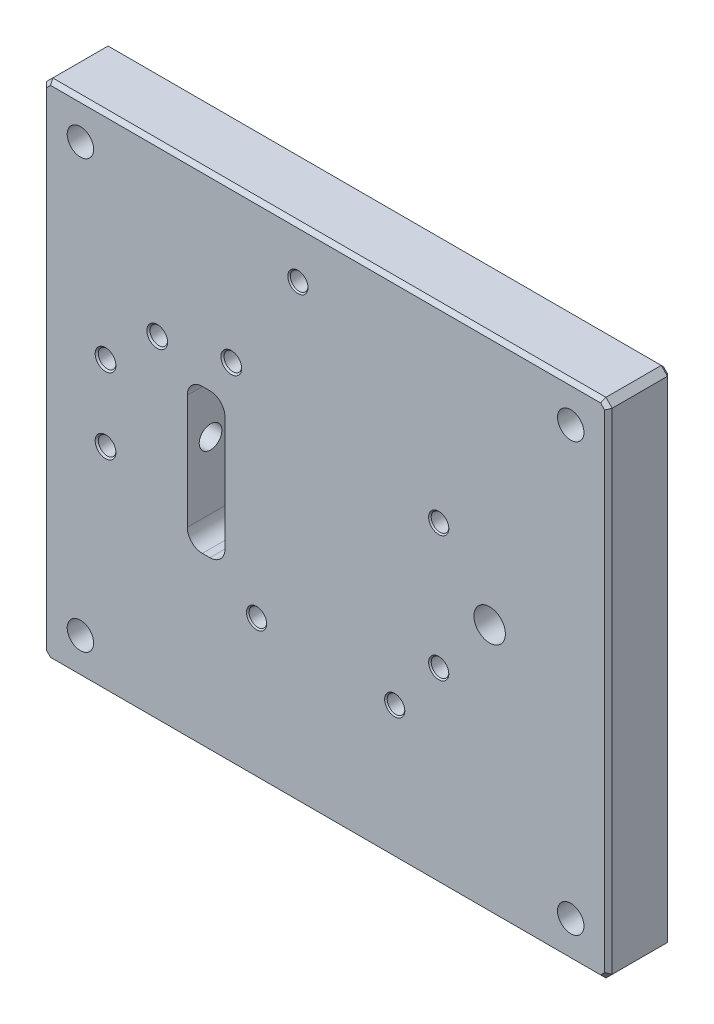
ISO-10303-21;
HEADER;
FILE_DESCRIPTION(('STEP AP214'),'2;1');
FILE_NAME('part.step','',(''),(''),'','','');
FILE_SCHEMA(('AUTOMOTIVE_DESIGN { 1 0 10303 214 1 1 1 1 }'));
ENDSEC;
DATA;
#1=APPLICATION_CONTEXT('core data for automotive mechanical design processes');
#2=APPLICATION_PROTOCOL_DEFINITION('international standard','automotive_design',2000,#1);
#3=PRODUCT_CONTEXT('',#1,'mechanical');
#4=PRODUCT('Part','Part','',(#3));
#5=PRODUCT_RELATED_PRODUCT_CATEGORY('part','',(#4));
#6=PRODUCT_DEFINITION_FORMATION('','',#4);
#7=PRODUCT_DEFINITION_CONTEXT('part definition',#1,'design');
#8=PRODUCT_DEFINITION('design','',#6,#7);
#9=PRODUCT_DEFINITION_SHAPE('','',#8);
#10=(LENGTH_UNIT() NAMED_UNIT(*) SI_UNIT(.MILLI.,.METRE.));
#11=(NAMED_UNIT(*) PLANE_ANGLE_UNIT() SI_UNIT($,.RADIAN.));
#12=(NAMED_UNIT(*) SI_UNIT($,.STERADIAN.) SOLID_ANGLE_UNIT());
#13=UNCERTAINTY_MEASURE_WITH_UNIT(LENGTH_MEASURE(1.E-05),#10,'distance_accuracy_value','');
#14=(GEOMETRIC_REPRESENTATION_CONTEXT(3) GLOBAL_UNCERTAINTY_ASSIGNED_CONTEXT((#13)) GLOBAL_UNIT_ASSIGNED_CONTEXT((#10,
#11,#12)) REPRESENTATION_CONTEXT('',''));
#15=CARTESIAN_POINT('',(0.,0.,0.));
#16=DIRECTION('',(0.,0.,1.));
#17=DIRECTION('',(1.,0.,0.));
#18=AXIS2_PLACEMENT_3D('',#15,#16,#17);
#19=CARTESIAN_POINT('',(75.502,0.,-50.));
#20=DIRECTION('',(0.,0.,-1.));
#21=DIRECTION('',(-1.,0.,0.));
#22=AXIS2_PLACEMENT_3D('',#19,#20,#21);
#23=CYLINDRICAL_SURFACE('',#22,8.74999999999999);
#24=CARTESIAN_POINT('',(75.502,0.,-34.));
#25=DIRECTION('',(0.,0.,-1.));
#26=DIRECTION('',(-1.,0.,0.));
#27=AXIS2_PLACEMENT_3D('',#24,#25,#26);
#28=CIRCLE('',#27,8.74999999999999);
#29=CARTESIAN_POINT('',(66.752,0.,-34.));
#30=VERTEX_POINT('',#29);
#31=EDGE_CURVE('E380',#30,#30,#28,.T.);
#32=ORIENTED_EDGE('',*,*,#31,.T.);
#33=EDGE_LOOP('',(#32));
#34=FACE_BOUND('',#33,.T.);
#35=CARTESIAN_POINT('',(75.502,0.,-18.));
#36=DIRECTION('',(0.,0.,1.));
#37=DIRECTION('',(1.,0.,0.));
#38=AXIS2_PLACEMENT_3D('',#35,#36,#37);
#39=CIRCLE('',#38,8.74999999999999);
#40=CARTESIAN_POINT('',(84.252,0.,-18.));
#41=VERTEX_POINT('',#40);
#42=EDGE_CURVE('E368',#41,#41,#39,.F.);
#43=ORIENTED_EDGE('',*,*,#42,.F.);
#44=EDGE_LOOP('',(#43));
#45=FACE_BOUND('',#44,.T.);
#46=ADVANCED_FACE('F33',(#34,#45),#23,.F.);
#47=CARTESIAN_POINT('',(-280.,200.,-50.));
#48=DIRECTION('',(0.,0.,-1.));
#49=DIRECTION('',(-1.,0.,0.));
#50=AXIS2_PLACEMENT_3D('',#47,#48,#49);
#51=PLANE('',#50);
#52=DIRECTION('',(0.,1.,0.));
#53=VECTOR('',#52,1.);
#54=CARTESIAN_POINT('',(-277.,195.,-50.));
#55=LINE('',#54,#53);
#56=CARTESIAN_POINT('',(-277.,-193.757359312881,-50.));
#57=VERTEX_POINT('',#56);
#58=CARTESIAN_POINT('',(-277.,193.757359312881,-50.));
#59=VERTEX_POINT('',#58);
#60=EDGE_CURVE('E465',#57,#59,#55,.T.);
#61=ORIENTED_EDGE('',*,*,#60,.T.);
#62=DIRECTION('',(0.707106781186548,0.707106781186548,0.));
#63=VECTOR('',#62,1.);
#64=CARTESIAN_POINT('',(-272.87867965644,197.87867965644,-50.));
#65=LINE('',#64,#63);
#66=CARTESIAN_POINT('',(-273.757359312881,197.,-50.));
#67=VERTEX_POINT('',#66);
#68=EDGE_CURVE('E467',#59,#67,#65,.T.);
#69=ORIENTED_EDGE('',*,*,#68,.T.);
#70=DIRECTION('',(1.,0.,0.));
#71=VECTOR('',#70,1.);
#72=CARTESIAN_POINT('',(165.,197.,-50.));
#73=LINE('',#72,#71);
#74=CARTESIAN_POINT('',(163.757359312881,197.,-50.));
#75=VERTEX_POINT('',#74);
#76=EDGE_CURVE('E457',#67,#75,#73,.T.);
#77=ORIENTED_EDGE('',*,*,#76,.T.);
#78=DIRECTION('',(0.707106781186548,-0.707106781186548,0.));
#79=VECTOR('',#78,1.);
#80=CARTESIAN_POINT('',(167.87867965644,192.87867965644,-50.));
#81=LINE('',#80,#79);
#82=CARTESIAN_POINT('',(167.,193.757359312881,-50.));
#83=VERTEX_POINT('',#82);
#84=EDGE_CURVE('E449',#75,#83,#81,.T.);
#85=ORIENTED_EDGE('',*,*,#84,.T.);
#86=DIRECTION('',(0.,-1.,0.));
#87=VECTOR('',#86,1.);
#88=CARTESIAN_POINT('',(167.,-195.,-50.));
#89=LINE('',#88,#87);
#90=CARTESIAN_POINT('',(167.,-193.757359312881,-50.));
#91=VERTEX_POINT('',#90);
#92=EDGE_CURVE('E455',#83,#91,#89,.T.);
#93=ORIENTED_EDGE('',*,*,#92,.T.);
#94=DIRECTION('',(-0.707106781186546,-0.707106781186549,0.));
#95=VECTOR('',#94,1.);
#96=CARTESIAN_POINT('',(162.87867965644,-197.87867965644,-50.));
#97=LINE('',#96,#95);
#98=CARTESIAN_POINT('',(163.757359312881,-197.,-50.));
#99=VERTEX_POINT('',#98);
#100=EDGE_CURVE('E459',#91,#99,#97,.T.);
#101=ORIENTED_EDGE('',*,*,#100,.T.);
#102=DIRECTION('',(-1.,0.,0.));
#103=VECTOR('',#102,1.);
#104=CARTESIAN_POINT('',(-275.,-197.,-50.));
#105=LINE('',#104,#103);
#106=CARTESIAN_POINT('',(-273.757359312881,-197.,-50.));
#107=VERTEX_POINT('',#106);
#108=EDGE_CURVE('E461',#99,#107,#105,.T.);
#109=ORIENTED_EDGE('',*,*,#108,.T.);
#110=DIRECTION('',(-0.707106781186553,0.707106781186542,0.));
#111=VECTOR('',#110,1.);
#112=CARTESIAN_POINT('',(-277.87867965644,-192.87867965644,-50.));
#113=LINE('',#112,#111);
#114=EDGE_CURVE('E463',#107,#57,#113,.T.);
#115=ORIENTED_EDGE('',*,*,#114,.T.);
#116=EDGE_LOOP('',(#61,#69,#77,#85,#93,#101,#109,#115));
#117=FACE_BOUND('',#116,.T.);
#118=CARTESIAN_POINT('',(75.502,0.,-50.));
#119=DIRECTION('',(0.,0.,-1.));
#120=DIRECTION('',(-1.,0.,0.));
#121=AXIS2_PLACEMENT_3D('',#118,#119,#120);
#122=CIRCLE('',#121,13.75);
#123=CARTESIAN_POINT('',(61.752,0.,-50.));
#124=VERTEX_POINT('',#123);
#125=EDGE_CURVE('E371',#124,#124,#122,.T.);
#126=ORIENTED_EDGE('',*,*,#125,.F.);
#127=EDGE_LOOP('',(#126));
#128=FACE_BOUND('',#127,.T.);
#129=CARTESIAN_POINT('',(-250.,170.,-50.));
#130=DIRECTION('',(0.,0.,-1.));
#131=DIRECTION('',(1.,0.,0.));
#132=AXIS2_PLACEMENT_3D('',#129,#130,#131);
#133=CIRCLE('',#132,10.5);
#134=CARTESIAN_POINT('',(-239.5,170.,-50.));
#135=VERTEX_POINT('',#134);
#136=EDGE_CURVE('E408',#135,#135,#133,.T.);
#137=ORIENTED_EDGE('',*,*,#136,.F.);
#138=EDGE_LOOP('',(#137));
#139=FACE_BOUND('',#138,.T.);
#140=CARTESIAN_POINT('',(-250.,-170.,-50.));
#141=DIRECTION('',(0.,0.,-1.));
#142=DIRECTION('',(1.,0.,0.));
#143=AXIS2_PLACEMENT_3D('',#140,#141,#142);
#144=CIRCLE('',#143,10.5);
#145=CARTESIAN_POINT('',(-239.5,-170.,-50.));
#146=VERTEX_POINT('',#145);
#147=EDGE_CURVE('E420',#146,#146,#144,.T.);
#148=ORIENTED_EDGE('',*,*,#147,.F.);
#149=EDGE_LOOP('',(#148));
#150=FACE_BOUND('',#149,.T.);
#151=CARTESIAN_POINT('',(140.,-170.,-50.));
#152=DIRECTION('',(0.,0.,-1.));
#153=DIRECTION('',(1.,0.,0.));
#154=AXIS2_PLACEMENT_3D('',#151,#152,#153);
#155=CIRCLE('',#154,10.5);
#156=CARTESIAN_POINT('',(150.5,-170.,-50.));
#157=VERTEX_POINT('',#156);
#158=EDGE_CURVE('E414',#157,#157,#155,.T.);
#159=ORIENTED_EDGE('',*,*,#158,.F.);
#160=EDGE_LOOP('',(#159));
#161=FACE_BOUND('',#160,.T.);
#162=CARTESIAN_POINT('',(140.,170.,-50.));
#163=DIRECTION('',(0.,0.,-1.));
#164=DIRECTION('',(1.,0.,0.));
#165=AXIS2_PLACEMENT_3D('',#162,#163,#164);
#166=CIRCLE('',#165,10.5);
#167=CARTESIAN_POINT('',(150.5,170.,-50.));
#168=VERTEX_POINT('',#167);
#169=EDGE_CURVE('E402',#168,#168,#166,.T.);
#170=ORIENTED_EDGE('',*,*,#169,.F.);
#171=EDGE_LOOP('',(#170));
#172=FACE_BOUND('',#171,.T.);
#173=ADVANCED_FACE('F664',(#117,#128,#139,#150,#161,#172),#51,.T.);
#174=CARTESIAN_POINT('',(-280.,200.,0.));
#175=DIRECTION('',(0.,0.,-1.));
#176=DIRECTION('',(-1.,0.,0.));
#177=AXIS2_PLACEMENT_3D('',#174,#175,#176);
#178=PLANE('',#177);
#179=DIRECTION('',(0.,1.,0.));
#180=VECTOR('',#179,1.);
#181=CARTESIAN_POINT('',(167.,200.,0.));
#182=LINE('',#181,#180);
#183=CARTESIAN_POINT('',(167.,-193.757359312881,0.));
#184=VERTEX_POINT('',#183);
#185=CARTESIAN_POINT('',(167.,193.757359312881,0.));
#186=VERTEX_POINT('',#185);
#187=EDGE_CURVE('E42',#184,#186,#182,.T.);
#188=ORIENTED_EDGE('',*,*,#187,.T.);
#189=DIRECTION('',(-0.707106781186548,0.707106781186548,0.));
#190=VECTOR('',#189,1.);
#191=CARTESIAN_POINT('',(-59.6213203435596,420.37867965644,0.));
#192=LINE('',#191,#190);
#193=CARTESIAN_POINT('',(163.757359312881,197.,0.));
#194=VERTEX_POINT('',#193);
#195=EDGE_CURVE('E11',#186,#194,#192,.T.);
#196=ORIENTED_EDGE('',*,*,#195,.T.);
#197=DIRECTION('',(-1.,0.,0.));
#198=VECTOR('',#197,1.);
#199=CARTESIAN_POINT('',(-280.,197.,0.));
#200=LINE('',#199,#198);
#201=CARTESIAN_POINT('',(-273.757359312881,197.,0.));
#202=VERTEX_POINT('',#201);
#203=EDGE_CURVE('E504',#194,#202,#200,.T.);
#204=ORIENTED_EDGE('',*,*,#203,.T.);
#205=DIRECTION('',(-0.707106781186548,-0.707106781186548,0.));
#206=VECTOR('',#205,1.);
#207=CARTESIAN_POINT('',(-275.37867965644,195.37867965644,0.));
#208=LINE('',#207,#206);
#209=CARTESIAN_POINT('',(-277.,193.757359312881,0.));
#210=VERTEX_POINT('',#209);
#211=EDGE_CURVE('E506',#202,#210,#208,.T.);
#212=ORIENTED_EDGE('',*,*,#211,.T.);
#213=DIRECTION('',(0.,-1.,0.));
#214=VECTOR('',#213,1.);
#215=CARTESIAN_POINT('',(-277.,200.,0.));
#216=LINE('',#215,#214);
#217=CARTESIAN_POINT('',(-277.,-193.757359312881,0.));
#218=VERTEX_POINT('',#217);
#219=EDGE_CURVE('E508',#210,#218,#216,.T.);
#220=ORIENTED_EDGE('',*,*,#219,.T.);
#221=DIRECTION('',(0.707106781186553,-0.707106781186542,0.));
#222=VECTOR('',#221,1.);
#223=CARTESIAN_POINT('',(-475.37867965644,4.62132034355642,0.));
#224=LINE('',#223,#222);
#225=CARTESIAN_POINT('',(-273.757359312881,-197.,0.));
#226=VERTEX_POINT('',#225);
#227=EDGE_CURVE('E510',#218,#226,#224,.T.);
#228=ORIENTED_EDGE('',*,*,#227,.T.);
#229=DIRECTION('',(1.,0.,0.));
#230=VECTOR('',#229,1.);
#231=CARTESIAN_POINT('',(-280.,-197.,0.));
#232=LINE('',#231,#230);
#233=CARTESIAN_POINT('',(163.757359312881,-197.,0.));
#234=VERTEX_POINT('',#233);
#235=EDGE_CURVE('E512',#226,#234,#232,.T.);
#236=ORIENTED_EDGE('',*,*,#235,.T.);
#237=DIRECTION('',(0.707106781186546,0.707106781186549,0.));
#238=VECTOR('',#237,1.);
#239=CARTESIAN_POINT('',(140.378679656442,-220.378679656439,0.));
#240=LINE('',#239,#238);
#241=EDGE_CURVE('E53',#234,#184,#240,.T.);
#242=ORIENTED_EDGE('',*,*,#241,.T.);
#243=EDGE_LOOP('',(#188,#196,#204,#212,#220,#228,#236,#242));
#244=FACE_BOUND('',#243,.T.);
#245=CARTESIAN_POINT('',(-230.,30.,0.));
#246=DIRECTION('',(0.,0.,1.));
#247=DIRECTION('',(1.,0.,0.));
#248=AXIS2_PLACEMENT_3D('',#245,#246,#247);
#249=CIRCLE('',#248,8.25000000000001);
#250=CARTESIAN_POINT('',(-221.75,30.,0.));
#251=VERTEX_POINT('',#250);
#252=EDGE_CURVE('E236',#251,#251,#249,.T.);
#253=ORIENTED_EDGE('',*,*,#252,.F.);
#254=EDGE_LOOP('',(#253));
#255=FACE_BOUND('',#254,.T.);
#256=CARTESIAN_POINT('',(-130.,78.,0.));
#257=DIRECTION('',(0.,0.,1.));
#258=DIRECTION('',(1.,0.,0.));
#259=AXIS2_PLACEMENT_3D('',#256,#257,#258);
#260=CIRCLE('',#259,8.25000000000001);
#261=CARTESIAN_POINT('',(-121.75,78.,0.));
#262=VERTEX_POINT('',#261);
#263=EDGE_CURVE('E229',#262,#262,#260,.T.);
#264=ORIENTED_EDGE('',*,*,#263,.F.);
#265=EDGE_LOOP('',(#264));
#266=FACE_BOUND('',#265,.T.);
#267=CARTESIAN_POINT('',(-188.891628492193,66.5206231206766,0.));
#268=DIRECTION('',(0.,0.,1.));
#269=DIRECTION('',(1.,0.,0.));
#270=AXIS2_PLACEMENT_3D('',#267,#268,#269);
#271=CIRCLE('',#270,8.25000000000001);
#272=CARTESIAN_POINT('',(-180.641628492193,66.5206231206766,0.));
#273=VERTEX_POINT('',#272);
#274=EDGE_CURVE('E245',#273,#273,#271,.T.);
#275=ORIENTED_EDGE('',*,*,#274,.F.);
#276=EDGE_LOOP('',(#275));
#277=FACE_BOUND('',#276,.T.);
#278=CARTESIAN_POINT('',(-230.,-30.,0.));
#279=DIRECTION('',(0.,0.,1.));
#280=DIRECTION('',(1.,0.,0.));
#281=AXIS2_PLACEMENT_3D('',#278,#279,#280);
#282=CIRCLE('',#281,8.25000000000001);
#283=CARTESIAN_POINT('',(-221.75,-30.,0.));
#284=VERTEX_POINT('',#283);
#285=EDGE_CURVE('E254',#284,#284,#282,.T.);
#286=ORIENTED_EDGE('',*,*,#285,.F.);
#287=EDGE_LOOP('',(#286));
#288=FACE_BOUND('',#287,.T.);
#289=CARTESIAN_POINT('',(-77.,160.,0.));
#290=DIRECTION('',(0.,0.,1.));
#291=DIRECTION('',(1.,0.,0.));
#292=AXIS2_PLACEMENT_3D('',#289,#290,#291);
#293=CIRCLE('',#292,8.025);
#294=CARTESIAN_POINT('',(-68.975,160.,0.));
#295=VERTEX_POINT('',#294);
#296=EDGE_CURVE('E263',#295,#295,#293,.T.);
#297=ORIENTED_EDGE('',*,*,#296,.F.);
#298=EDGE_LOOP('',(#297));
#299=FACE_BOUND('',#298,.T.);
#300=CARTESIAN_POINT('',(-109.88630487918,-88.,0.));
#301=DIRECTION('',(0.,0.,1.));
#302=DIRECTION('',(1.,0.,0.));
#303=AXIS2_PLACEMENT_3D('',#300,#301,#302);
#304=CIRCLE('',#303,8.025);
#305=CARTESIAN_POINT('',(-101.86130487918,-88.,0.));
#306=VERTEX_POINT('',#305);
#307=EDGE_CURVE('E272',#306,#306,#304,.T.);
#308=ORIENTED_EDGE('',*,*,#307,.F.);
#309=EDGE_LOOP('',(#308));
#310=FACE_BOUND('',#309,.T.);
#311=CARTESIAN_POINT('',(0.,-93.,0.));
#312=DIRECTION('',(0.,0.,1.));
#313=DIRECTION('',(1.,0.,0.));
#314=AXIS2_PLACEMENT_3D('',#311,#312,#313);
#315=CIRCLE('',#314,8.025);
#316=CARTESIAN_POINT('',(8.025,-93.,0.));
#317=VERTEX_POINT('',#316);
#318=EDGE_CURVE('E281',#317,#317,#315,.T.);
#319=ORIENTED_EDGE('',*,*,#318,.F.);
#320=EDGE_LOOP('',(#319));
#321=FACE_BOUND('',#320,.T.);
#322=DIRECTION('',(1.,0.,0.));
#323=VECTOR('',#322,1.);
#324=CARTESIAN_POINT('',(-153.,-65.,0.));
#325=LINE('',#324,#323);
#326=CARTESIAN_POINT('',(-153.,-65.,0.));
#327=VERTEX_POINT('',#326);
#328=CARTESIAN_POINT('',(-147.,-65.,0.));
#329=VERTEX_POINT('',#328);
#330=EDGE_CURVE('E328',#327,#329,#325,.T.);
#331=ORIENTED_EDGE('',*,*,#330,.F.);
#332=CARTESIAN_POINT('',(-153.,-53.,0.));
#333=DIRECTION('',(0.,0.,1.));
#334=DIRECTION('',(1.,0.,0.));
#335=AXIS2_PLACEMENT_3D('',#332,#333,#334);
#336=CIRCLE('',#335,12.);
#337=CARTESIAN_POINT('',(-165.,-53.,0.));
#338=VERTEX_POINT('',#337);
#339=EDGE_CURVE('E300',#338,#327,#336,.T.);
#340=ORIENTED_EDGE('',*,*,#339,.F.);
#341=DIRECTION('',(0.,-1.,0.));
#342=VECTOR('',#341,1.);
#343=CARTESIAN_POINT('',(-165.,38.,0.));
#344=LINE('',#343,#342);
#345=CARTESIAN_POINT('',(-165.,38.,0.));
#346=VERTEX_POINT('',#345);
#347=EDGE_CURVE('E305',#346,#338,#344,.T.);
#348=ORIENTED_EDGE('',*,*,#347,.F.);
#349=CARTESIAN_POINT('',(-153.,38.,0.));
#350=DIRECTION('',(0.,0.,1.));
#351=DIRECTION('',(1.,0.,0.));
#352=AXIS2_PLACEMENT_3D('',#349,#350,#351);
#353=CIRCLE('',#352,12.);
#354=CARTESIAN_POINT('',(-153.,50.,0.));
#355=VERTEX_POINT('',#354);
#356=EDGE_CURVE('E343',#355,#346,#353,.T.);
#357=ORIENTED_EDGE('',*,*,#356,.F.);
#358=DIRECTION('',(-1.,0.,0.));
#359=VECTOR('',#358,1.);
#360=CARTESIAN_POINT('',(-153.,50.,0.));
#361=LINE('',#360,#359);
#362=CARTESIAN_POINT('',(-147.,50.,0.));
#363=VERTEX_POINT('',#362);
#364=EDGE_CURVE('E340',#363,#355,#361,.T.);
#365=ORIENTED_EDGE('',*,*,#364,.F.);
#366=CARTESIAN_POINT('',(-147.,38.,0.));
#367=DIRECTION('',(0.,0.,1.));
#368=DIRECTION('',(-1.,0.,0.));
#369=AXIS2_PLACEMENT_3D('',#366,#367,#368);
#370=CIRCLE('',#369,12.);
#371=CARTESIAN_POINT('',(-135.,38.,0.));
#372=VERTEX_POINT('',#371);
#373=EDGE_CURVE('E337',#372,#363,#370,.T.);
#374=ORIENTED_EDGE('',*,*,#373,.F.);
#375=DIRECTION('',(0.,1.,0.));
#376=VECTOR('',#375,1.);
#377=CARTESIAN_POINT('',(-135.,38.,0.));
#378=LINE('',#377,#376);
#379=CARTESIAN_POINT('',(-135.,-53.,0.));
#380=VERTEX_POINT('',#379);
#381=EDGE_CURVE('E334',#380,#372,#378,.T.);
#382=ORIENTED_EDGE('',*,*,#381,.F.);
#383=CARTESIAN_POINT('',(-147.,-53.,0.));
#384=DIRECTION('',(0.,0.,1.));
#385=DIRECTION('',(1.,0.,0.));
#386=AXIS2_PLACEMENT_3D('',#383,#384,#385);
#387=CIRCLE('',#386,12.);
#388=EDGE_CURVE('E331',#329,#380,#387,.T.);
#389=ORIENTED_EDGE('',*,*,#388,.F.);
#390=EDGE_LOOP('',(#331,#340,#348,#357,#365,#374,#382,#389));
#391=FACE_BOUND('',#390,.T.);
#392=CARTESIAN_POINT('',(75.502,0.,0.));
#393=DIRECTION('',(0.,0.,1.));
#394=DIRECTION('',(1.,0.,0.));
#395=AXIS2_PLACEMENT_3D('',#392,#393,#394);
#396=CIRCLE('',#395,12.5);
#397=CARTESIAN_POINT('',(88.002,0.,0.));
#398=VERTEX_POINT('',#397);
#399=EDGE_CURVE('E350',#398,#398,#396,.T.);
#400=ORIENTED_EDGE('',*,*,#399,.F.);
#401=EDGE_LOOP('',(#400));
#402=FACE_BOUND('',#401,.T.);
#403=CARTESIAN_POINT('',(35.,50.,0.));
#404=DIRECTION('',(0.,0.,1.));
#405=DIRECTION('',(1.,0.,0.));
#406=AXIS2_PLACEMENT_3D('',#403,#404,#405);
#407=CIRCLE('',#406,8.025);
#408=CARTESIAN_POINT('',(43.025,50.,0.));
#409=VERTEX_POINT('',#408);
#410=EDGE_CURVE('E383',#409,#409,#407,.T.);
#411=ORIENTED_EDGE('',*,*,#410,.F.);
#412=EDGE_LOOP('',(#411));
#413=FACE_BOUND('',#412,.T.);
#414=CARTESIAN_POINT('',(35.,-50.,0.));
#415=DIRECTION('',(0.,0.,1.));
#416=DIRECTION('',(1.,0.,0.));
#417=AXIS2_PLACEMENT_3D('',#414,#415,#416);
#418=CIRCLE('',#417,8.025);
#419=CARTESIAN_POINT('',(43.025,-50.,0.));
#420=VERTEX_POINT('',#419);
#421=EDGE_CURVE('E392',#420,#420,#418,.T.);
#422=ORIENTED_EDGE('',*,*,#421,.F.);
#423=EDGE_LOOP('',(#422));
#424=FACE_BOUND('',#423,.T.);
#425=CARTESIAN_POINT('',(-250.,170.,0.));
#426=DIRECTION('',(0.,0.,-1.));
#427=DIRECTION('',(1.,0.,0.));
#428=AXIS2_PLACEMENT_3D('',#425,#426,#427);
#429=CIRCLE('',#428,10.5);
#430=CARTESIAN_POINT('',(-239.5,170.,0.));
#431=VERTEX_POINT('',#430);
#432=EDGE_CURVE('E405',#431,#431,#429,.T.);
#433=ORIENTED_EDGE('',*,*,#432,.T.);
#434=EDGE_LOOP('',(#433));
#435=FACE_BOUND('',#434,.T.);
#436=CARTESIAN_POINT('',(-250.,-170.,0.));
#437=DIRECTION('',(0.,0.,-1.));
#438=DIRECTION('',(1.,0.,0.));
#439=AXIS2_PLACEMENT_3D('',#436,#437,#438);
#440=CIRCLE('',#439,10.5);
#441=CARTESIAN_POINT('',(-239.5,-170.,0.));
#442=VERTEX_POINT('',#441);
#443=EDGE_CURVE('E417',#442,#442,#440,.T.);
#444=ORIENTED_EDGE('',*,*,#443,.T.);
#445=EDGE_LOOP('',(#444));
#446=FACE_BOUND('',#445,.T.);
#447=CARTESIAN_POINT('',(140.,-170.,0.));
#448=DIRECTION('',(0.,0.,-1.));
#449=DIRECTION('',(1.,0.,0.));
#450=AXIS2_PLACEMENT_3D('',#447,#448,#449);
#451=CIRCLE('',#450,10.5);
#452=CARTESIAN_POINT('',(150.5,-170.,0.));
#453=VERTEX_POINT('',#452);
#454=EDGE_CURVE('E411',#453,#453,#451,.T.);
#455=ORIENTED_EDGE('',*,*,#454,.T.);
#456=EDGE_LOOP('',(#455));
#457=FACE_BOUND('',#456,.T.);
#458=CARTESIAN_POINT('',(140.,170.,0.));
#459=DIRECTION('',(0.,0.,-1.));
#460=DIRECTION('',(1.,0.,0.));
#461=AXIS2_PLACEMENT_3D('',#458,#459,#460);
#462=CIRCLE('',#461,10.5);
#463=CARTESIAN_POINT('',(150.5,170.,0.));
#464=VERTEX_POINT('',#463);
#465=EDGE_CURVE('E401',#464,#464,#462,.T.);
#466=ORIENTED_EDGE('',*,*,#465,.T.);
#467=EDGE_LOOP('',(#466));
#468=FACE_BOUND('',#467,.T.);
#469=ADVANCED_FACE('F569',(#244,#255,#266,#277,#288,#299,#310,#321,#391,#402,#413,#424,#435,
#446,#457,#468),#178,.F.);
#470=CARTESIAN_POINT('',(-280.,-195.,-50.));
#471=DIRECTION('',(1.,0.,0.));
#472=DIRECTION('',(0.,1.,0.));
#473=AXIS2_PLACEMENT_3D('',#470,#471,#472);
#474=PLANE('',#473);
#475=CARTESIAN_POINT('',(-280.,0.,-18.5));
#476=DIRECTION('',(1.,0.,0.));
#477=DIRECTION('',(0.,0.,-1.));
#478=AXIS2_PLACEMENT_3D('',#475,#476,#477);
#479=CIRCLE('',#478,9.);
#480=CARTESIAN_POINT('',(-280.,0.,-27.5));
#481=VERTEX_POINT('',#480);
#482=EDGE_CURVE('E293',#481,#481,#479,.T.);
#483=ORIENTED_EDGE('',*,*,#482,.T.);
#484=EDGE_LOOP('',(#483));
#485=FACE_BOUND('',#484,.T.);
#486=DIRECTION('',(0.,0.,1.));
#487=VECTOR('',#486,1.);
#488=CARTESIAN_POINT('',(-280.,195.,-50.));
#489=LINE('',#488,#487);
#490=CARTESIAN_POINT('',(-280.,195.,-47.0000000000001));
#491=VERTEX_POINT('',#490);
#492=CARTESIAN_POINT('',(-280.,195.,-2.99999999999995));
#493=VERTEX_POINT('',#492);
#494=EDGE_CURVE('E446',#491,#493,#489,.T.);
#495=ORIENTED_EDGE('',*,*,#494,.F.);
#496=DIRECTION('',(0.,-1.,0.));
#497=VECTOR('',#496,1.);
#498=CARTESIAN_POINT('',(-280.,-195.,-47.0000000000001));
#499=LINE('',#498,#497);
#500=CARTESIAN_POINT('',(-280.,-195.,-47.0000000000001));
#501=VERTEX_POINT('',#500);
#502=EDGE_CURVE('E477',#491,#501,#499,.T.);
#503=ORIENTED_EDGE('',*,*,#502,.T.);
#504=DIRECTION('',(0.,0.,1.));
#505=VECTOR('',#504,1.);
#506=CARTESIAN_POINT('',(-280.,-195.,-50.));
#507=LINE('',#506,#505);
#508=CARTESIAN_POINT('',(-280.,-195.,-2.99999999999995));
#509=VERTEX_POINT('',#508);
#510=EDGE_CURVE('E423',#501,#509,#507,.T.);
#511=ORIENTED_EDGE('',*,*,#510,.T.);
#512=DIRECTION('',(0.,1.,0.));
#513=VECTOR('',#512,1.);
#514=CARTESIAN_POINT('',(-280.,-195.,-2.99999999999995));
#515=LINE('',#514,#513);
#516=EDGE_CURVE('E475',#509,#493,#515,.T.);
#517=ORIENTED_EDGE('',*,*,#516,.T.);
#518=EDGE_LOOP('',(#495,#503,#511,#517));
#519=FACE_BOUND('',#518,.T.);
#520=ADVANCED_FACE('F616',(#485,#519),#474,.F.);
#521=CARTESIAN_POINT('',(-280.,195.,-50.));
#522=DIRECTION('',(0.707106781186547,-0.707106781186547,0.));
#523=DIRECTION('',(0.707106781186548,0.707106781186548,0.));
#524=AXIS2_PLACEMENT_3D('',#521,#522,#523);
#525=PLANE('',#524);
#526=DIRECTION('',(0.,0.,1.));
#527=VECTOR('',#526,1.);
#528=CARTESIAN_POINT('',(-275.,200.,-50.));
#529=LINE('',#528,#527);
#530=CARTESIAN_POINT('',(-275.,200.,-47.0000000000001));
#531=VERTEX_POINT('',#530);
#532=CARTESIAN_POINT('',(-275.,200.,-2.99999999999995));
#533=VERTEX_POINT('',#532);
#534=EDGE_CURVE('E443',#531,#533,#529,.T.);
#535=ORIENTED_EDGE('',*,*,#534,.F.);
#536=DIRECTION('',(-0.707106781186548,-0.707106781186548,0.));
#537=VECTOR('',#536,1.);
#538=CARTESIAN_POINT('',(-280.,195.,-47.0000000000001));
#539=LINE('',#538,#537);
#540=EDGE_CURVE('E472',#531,#491,#539,.T.);
#541=ORIENTED_EDGE('',*,*,#540,.T.);
#542=ORIENTED_EDGE('',*,*,#494,.T.);
#543=DIRECTION('',(0.707106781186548,0.707106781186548,0.));
#544=VECTOR('',#543,1.);
#545=CARTESIAN_POINT('',(-280.,195.,-2.99999999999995));
#546=LINE('',#545,#544);
#547=EDGE_CURVE('E470',#493,#533,#546,.T.);
#548=ORIENTED_EDGE('',*,*,#547,.T.);
#549=EDGE_LOOP('',(#535,#541,#542,#548));
#550=FACE_BOUND('',#549,.T.);
#551=ADVANCED_FACE('F603',(#550),#525,.F.);
#552=CARTESIAN_POINT('',(-275.,200.,-50.));
#553=DIRECTION('',(0.,-1.,0.));
#554=DIRECTION('',(0.,0.,-1.));
#555=AXIS2_PLACEMENT_3D('',#552,#553,#554);
#556=PLANE('',#555);
#557=DIRECTION('',(0.,0.,1.));
#558=VECTOR('',#557,1.);
#559=CARTESIAN_POINT('',(165.,200.,-50.));
#560=LINE('',#559,#558);
#561=CARTESIAN_POINT('',(165.,200.,-47.0000000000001));
#562=VERTEX_POINT('',#561);
#563=CARTESIAN_POINT('',(165.,200.,-2.99999999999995));
#564=VERTEX_POINT('',#563);
#565=EDGE_CURVE('E440',#562,#564,#560,.T.);
#566=ORIENTED_EDGE('',*,*,#565,.F.);
#567=DIRECTION('',(-1.,0.,0.));
#568=VECTOR('',#567,1.);
#569=CARTESIAN_POINT('',(-275.,200.,-47.0000000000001));
#570=LINE('',#569,#568);
#571=EDGE_CURVE('E493',#562,#531,#570,.T.);
#572=ORIENTED_EDGE('',*,*,#571,.T.);
#573=ORIENTED_EDGE('',*,*,#534,.T.);
#574=DIRECTION('',(1.,0.,0.));
#575=VECTOR('',#574,1.);
#576=CARTESIAN_POINT('',(-275.,200.,-2.99999999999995));
#577=LINE('',#576,#575);
#578=EDGE_CURVE('E491',#533,#564,#577,.T.);
#579=ORIENTED_EDGE('',*,*,#578,.T.);
#580=EDGE_LOOP('',(#566,#572,#573,#579));
#581=FACE_BOUND('',#580,.T.);
#582=ADVANCED_FACE('F585',(#581),#556,.F.);
#583=CARTESIAN_POINT('',(165.,200.,-50.));
#584=DIRECTION('',(-0.707106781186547,-0.707106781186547,0.));
#585=DIRECTION('',(0.707106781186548,-0.707106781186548,0.));
#586=AXIS2_PLACEMENT_3D('',#583,#584,#585);
#587=PLANE('',#586);
#588=DIRECTION('',(0.,0.,1.));
#589=VECTOR('',#588,1.);
#590=CARTESIAN_POINT('',(170.,195.,-50.));
#591=LINE('',#590,#589);
#592=CARTESIAN_POINT('',(170.,195.,-47.0000000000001));
#593=VERTEX_POINT('',#592);
#594=CARTESIAN_POINT('',(170.,195.,-2.99999999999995));
#595=VERTEX_POINT('',#594);
#596=EDGE_CURVE('E437',#593,#595,#591,.T.);
#597=ORIENTED_EDGE('',*,*,#596,.F.);
#598=DIRECTION('',(-0.707106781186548,0.707106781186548,0.));
#599=VECTOR('',#598,1.);
#600=CARTESIAN_POINT('',(165.,200.,-47.0000000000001));
#601=LINE('',#600,#599);
#602=EDGE_CURVE('E502',#593,#562,#601,.T.);
#603=ORIENTED_EDGE('',*,*,#602,.T.);
#604=ORIENTED_EDGE('',*,*,#565,.T.);
#605=DIRECTION('',(0.707106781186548,-0.707106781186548,0.));
#606=VECTOR('',#605,1.);
#607=CARTESIAN_POINT('',(165.,200.,-2.99999999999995));
#608=LINE('',#607,#606);
#609=EDGE_CURVE('E499',#564,#595,#608,.T.);
#610=ORIENTED_EDGE('',*,*,#609,.T.);
#611=EDGE_LOOP('',(#597,#603,#604,#610));
#612=FACE_BOUND('',#611,.T.);
#613=ADVANCED_FACE('F590',(#612),#587,.F.);
#614=CARTESIAN_POINT('',(170.,195.,-50.));
#615=DIRECTION('',(-1.,0.,0.));
#616=DIRECTION('',(0.,0.,1.));
#617=AXIS2_PLACEMENT_3D('',#614,#615,#616);
#618=PLANE('',#617);
#619=DIRECTION('',(0.,0.,1.));
#620=VECTOR('',#619,1.);
#621=CARTESIAN_POINT('',(170.,-195.,-50.));
#622=LINE('',#621,#620);
#623=CARTESIAN_POINT('',(170.,-195.,-47.0000000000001));
#624=VERTEX_POINT('',#623);
#625=CARTESIAN_POINT('',(170.,-195.,-2.99999999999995));
#626=VERTEX_POINT('',#625);
#627=EDGE_CURVE('E434',#624,#626,#622,.T.);
#628=ORIENTED_EDGE('',*,*,#627,.F.);
#629=DIRECTION('',(0.,1.,0.));
#630=VECTOR('',#629,1.);
#631=CARTESIAN_POINT('',(170.,195.,-47.0000000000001));
#632=LINE('',#631,#630);
#633=EDGE_CURVE('E497',#624,#593,#632,.T.);
#634=ORIENTED_EDGE('',*,*,#633,.T.);
#635=ORIENTED_EDGE('',*,*,#596,.T.);
#636=DIRECTION('',(0.,-1.,0.));
#637=VECTOR('',#636,1.);
#638=CARTESIAN_POINT('',(170.,195.,-2.99999999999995));
#639=LINE('',#638,#637);
#640=EDGE_CURVE('E495',#595,#626,#639,.T.);
#641=ORIENTED_EDGE('',*,*,#640,.T.);
#642=EDGE_LOOP('',(#628,#634,#635,#641));
#643=FACE_BOUND('',#642,.T.);
#644=ADVANCED_FACE('F647',(#643),#618,.F.);
#645=CARTESIAN_POINT('',(170.,-195.,-50.));
#646=DIRECTION('',(-0.707106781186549,0.707106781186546,0.));
#647=DIRECTION('',(-0.707106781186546,-0.707106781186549,0.));
#648=AXIS2_PLACEMENT_3D('',#645,#646,#647);
#649=PLANE('',#648);
#650=DIRECTION('',(0.,0.,1.));
#651=VECTOR('',#650,1.);
#652=CARTESIAN_POINT('',(165.,-200.,-50.));
#653=LINE('',#652,#651);
#654=CARTESIAN_POINT('',(165.,-200.,-47.0000000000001));
#655=VERTEX_POINT('',#654);
#656=CARTESIAN_POINT('',(165.,-200.,-2.99999999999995));
#657=VERTEX_POINT('',#656);
#658=EDGE_CURVE('E431',#655,#657,#653,.T.);
#659=ORIENTED_EDGE('',*,*,#658,.F.);
#660=DIRECTION('',(0.707106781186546,0.707106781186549,0.));
#661=VECTOR('',#660,1.);
#662=CARTESIAN_POINT('',(170.,-195.,-47.0000000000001));
#663=LINE('',#662,#661);
#664=EDGE_CURVE('E489',#655,#624,#663,.T.);
#665=ORIENTED_EDGE('',*,*,#664,.T.);
#666=ORIENTED_EDGE('',*,*,#627,.T.);
#667=DIRECTION('',(-0.707106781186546,-0.707106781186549,0.));
#668=VECTOR('',#667,1.);
#669=CARTESIAN_POINT('',(170.,-195.,-2.99999999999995));
#670=LINE('',#669,#668);
#671=EDGE_CURVE('E487',#626,#657,#670,.T.);
#672=ORIENTED_EDGE('',*,*,#671,.T.);
#673=EDGE_LOOP('',(#659,#665,#666,#672));
#674=FACE_BOUND('',#673,.T.);
#675=ADVANCED_FACE('F635',(#674),#649,.F.);
#676=CARTESIAN_POINT('',(165.,-200.,-50.));
#677=DIRECTION('',(0.,1.,0.));
#678=DIRECTION('',(-1.,0.,0.));
#679=AXIS2_PLACEMENT_3D('',#676,#677,#678);
#680=PLANE('',#679);
#681=DIRECTION('',(0.,0.,1.));
#682=VECTOR('',#681,1.);
#683=CARTESIAN_POINT('',(-275.,-200.,-50.));
#684=LINE('',#683,#682);
#685=CARTESIAN_POINT('',(-275.,-200.,-47.0000000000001));
#686=VERTEX_POINT('',#685);
#687=CARTESIAN_POINT('',(-275.,-200.,-2.99999999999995));
#688=VERTEX_POINT('',#687);
#689=EDGE_CURVE('E428',#686,#688,#684,.T.);
#690=ORIENTED_EDGE('',*,*,#689,.F.);
#691=DIRECTION('',(1.,0.,0.));
#692=VECTOR('',#691,1.);
#693=CARTESIAN_POINT('',(165.,-200.,-47.0000000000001));
#694=LINE('',#693,#692);
#695=EDGE_CURVE('E485',#686,#655,#694,.T.);
#696=ORIENTED_EDGE('',*,*,#695,.T.);
#697=ORIENTED_EDGE('',*,*,#658,.T.);
#698=DIRECTION('',(-1.,0.,0.));
#699=VECTOR('',#698,1.);
#700=CARTESIAN_POINT('',(165.,-200.,-2.99999999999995));
#701=LINE('',#700,#699);
#702=EDGE_CURVE('E483',#657,#688,#701,.T.);
#703=ORIENTED_EDGE('',*,*,#702,.T.);
#704=EDGE_LOOP('',(#690,#696,#697,#703));
#705=FACE_BOUND('',#704,.T.);
#706=ADVANCED_FACE('F632',(#705),#680,.F.);
#707=CARTESIAN_POINT('',(-275.,-200.,-50.));
#708=DIRECTION('',(0.707106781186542,0.707106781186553,0.));
#709=DIRECTION('',(-0.707106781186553,0.707106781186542,0.));
#710=AXIS2_PLACEMENT_3D('',#707,#708,#709);
#711=PLANE('',#710);
#712=ORIENTED_EDGE('',*,*,#510,.F.);
#713=DIRECTION('',(0.707106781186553,-0.707106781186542,0.));
#714=VECTOR('',#713,1.);
#715=CARTESIAN_POINT('',(-275.,-200.,-47.));
#716=LINE('',#715,#714);
#717=EDGE_CURVE('E481',#501,#686,#716,.T.);
#718=ORIENTED_EDGE('',*,*,#717,.T.);
#719=ORIENTED_EDGE('',*,*,#689,.T.);
#720=DIRECTION('',(-0.707106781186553,0.707106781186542,0.));
#721=VECTOR('',#720,1.);
#722=CARTESIAN_POINT('',(-275.,-200.,-2.99999999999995));
#723=LINE('',#722,#721);
#724=EDGE_CURVE('E479',#688,#509,#723,.T.);
#725=ORIENTED_EDGE('',*,*,#724,.T.);
#726=EDGE_LOOP('',(#712,#718,#719,#725));
#727=FACE_BOUND('',#726,.T.);
#728=ADVANCED_FACE('F619',(#727),#711,.F.);
#729=CARTESIAN_POINT('',(-250.,-170.,-50.));
#730=DIRECTION('',(0.,0.,1.));
#731=DIRECTION('',(1.,0.,0.));
#732=AXIS2_PLACEMENT_3D('',#729,#730,#731);
#733=CYLINDRICAL_SURFACE('',#732,10.5);
#734=ORIENTED_EDGE('',*,*,#147,.T.);
#735=EDGE_LOOP('',(#734));
#736=FACE_BOUND('',#735,.T.);
#737=ORIENTED_EDGE('',*,*,#443,.F.);
#738=EDGE_LOOP('',(#737));
#739=FACE_BOUND('',#738,.T.);
#740=ADVANCED_FACE('F712',(#736,#739),#733,.F.);
#741=CARTESIAN_POINT('',(140.,-170.,-50.));
#742=DIRECTION('',(0.,0.,1.));
#743=DIRECTION('',(1.,0.,0.));
#744=AXIS2_PLACEMENT_3D('',#741,#742,#743);
#745=CYLINDRICAL_SURFACE('',#744,10.5);
#746=ORIENTED_EDGE('',*,*,#158,.T.);
#747=EDGE_LOOP('',(#746));
#748=FACE_BOUND('',#747,.T.);
#749=ORIENTED_EDGE('',*,*,#454,.F.);
#750=EDGE_LOOP('',(#749));
#751=FACE_BOUND('',#750,.T.);
#752=ADVANCED_FACE('F708',(#748,#751),#745,.F.);
#753=CARTESIAN_POINT('',(-250.,170.,-50.));
#754=DIRECTION('',(0.,0.,1.));
#755=DIRECTION('',(1.,0.,0.));
#756=AXIS2_PLACEMENT_3D('',#753,#754,#755);
#757=CYLINDRICAL_SURFACE('',#756,10.5);
#758=ORIENTED_EDGE('',*,*,#136,.T.);
#759=EDGE_LOOP('',(#758));
#760=FACE_BOUND('',#759,.T.);
#761=ORIENTED_EDGE('',*,*,#432,.F.);
#762=EDGE_LOOP('',(#761));
#763=FACE_BOUND('',#762,.T.);
#764=ADVANCED_FACE('F704',(#760,#763),#757,.F.);
#765=CARTESIAN_POINT('',(140.,170.,-50.));
#766=DIRECTION('',(0.,0.,1.));
#767=DIRECTION('',(1.,0.,0.));
#768=AXIS2_PLACEMENT_3D('',#765,#766,#767);
#769=CYLINDRICAL_SURFACE('',#768,10.5);
#770=ORIENTED_EDGE('',*,*,#169,.T.);
#771=EDGE_LOOP('',(#770));
#772=FACE_BOUND('',#771,.T.);
#773=ORIENTED_EDGE('',*,*,#465,.F.);
#774=EDGE_LOOP('',(#773));
#775=FACE_BOUND('',#774,.T.);
#776=ADVANCED_FACE('F700',(#772,#775),#769,.F.);
#777=CARTESIAN_POINT('',(35.,-50.,-35.));
#778=DIRECTION('',(0.,0.,1.));
#779=DIRECTION('',(1.,0.,0.));
#780=AXIS2_PLACEMENT_3D('',#777,#778,#779);
#781=CONICAL_SURFACE('',#780,6.99999999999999,1.02974425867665);
#782=CARTESIAN_POINT('',(35.,-50.,-39.2060243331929));
#783=VERTEX_POINT('',#782);
#784=VERTEX_LOOP('',#783);
#785=FACE_BOUND('',#784,.T.);
#786=CARTESIAN_POINT('',(35.,-50.,-35.));
#787=DIRECTION('',(0.,0.,1.));
#788=DIRECTION('',(1.,0.,0.));
#789=AXIS2_PLACEMENT_3D('',#786,#787,#788);
#790=CIRCLE('',#789,6.99999999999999);
#791=CARTESIAN_POINT('',(42.,-50.,-35.));
#792=VERTEX_POINT('',#791);
#793=EDGE_CURVE('E398',#792,#792,#790,.T.);
#794=ORIENTED_EDGE('',*,*,#793,.T.);
#795=EDGE_LOOP('',(#794));
#796=FACE_BOUND('',#795,.T.);
#797=ADVANCED_FACE('F696',(#785,#796),#781,.F.);
#798=CARTESIAN_POINT('',(35.,-50.,0.));
#799=DIRECTION('',(0.,0.,1.));
#800=DIRECTION('',(1.,0.,0.));
#801=AXIS2_PLACEMENT_3D('',#798,#799,#800);
#802=CYLINDRICAL_SURFACE('',#801,6.99999999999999);
#803=ORIENTED_EDGE('',*,*,#793,.F.);
#804=EDGE_LOOP('',(#803));
#805=FACE_BOUND('',#804,.T.);
#806=CARTESIAN_POINT('',(35.,-50.,-1.025));
#807=DIRECTION('',(0.,0.,1.));
#808=DIRECTION('',(1.,0.,0.));
#809=AXIS2_PLACEMENT_3D('',#806,#807,#808);
#810=CIRCLE('',#809,6.99999999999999);
#811=CARTESIAN_POINT('',(42.,-50.,-1.025));
#812=VERTEX_POINT('',#811);
#813=EDGE_CURVE('E395',#812,#812,#810,.T.);
#814=ORIENTED_EDGE('',*,*,#813,.T.);
#815=EDGE_LOOP('',(#814));
#816=FACE_BOUND('',#815,.T.);
#817=ADVANCED_FACE('F692',(#805,#816),#802,.F.);
#818=CARTESIAN_POINT('',(35.,-50.,0.));
#819=DIRECTION('',(0.,0.,1.));
#820=DIRECTION('',(1.,0.,0.));
#821=AXIS2_PLACEMENT_3D('',#818,#819,#820);
#822=CONICAL_SURFACE('',#821,8.025,0.785398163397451);
#823=ORIENTED_EDGE('',*,*,#813,.F.);
#824=EDGE_LOOP('',(#823));
#825=FACE_BOUND('',#824,.T.);
#826=ORIENTED_EDGE('',*,*,#421,.T.);
#827=EDGE_LOOP('',(#826));
#828=FACE_BOUND('',#827,.T.);
#829=ADVANCED_FACE('F688',(#825,#828),#822,.F.);
#830=CARTESIAN_POINT('',(35.,50.,-35.));
#831=DIRECTION('',(0.,0.,1.));
#832=DIRECTION('',(1.,0.,0.));
#833=AXIS2_PLACEMENT_3D('',#830,#831,#832);
#834=CONICAL_SURFACE('',#833,6.99999999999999,1.02974425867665);
#835=CARTESIAN_POINT('',(35.,50.,-39.2060243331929));
#836=VERTEX_POINT('',#835);
#837=VERTEX_LOOP('',#836);
#838=FACE_BOUND('',#837,.T.);
#839=CARTESIAN_POINT('',(35.,50.,-35.));
#840=DIRECTION('',(0.,0.,1.));
#841=DIRECTION('',(1.,0.,0.));
#842=AXIS2_PLACEMENT_3D('',#839,#840,#841);
#843=CIRCLE('',#842,6.99999999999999);
#844=CARTESIAN_POINT('',(42.,50.,-35.));
#845=VERTEX_POINT('',#844);
#846=EDGE_CURVE('E389',#845,#845,#843,.T.);
#847=ORIENTED_EDGE('',*,*,#846,.T.);
#848=EDGE_LOOP('',(#847));
#849=FACE_BOUND('',#848,.T.);
#850=ADVANCED_FACE('F684',(#838,#849),#834,.F.);
#851=CARTESIAN_POINT('',(35.,50.,0.));
#852=DIRECTION('',(0.,0.,1.));
#853=DIRECTION('',(1.,0.,0.));
#854=AXIS2_PLACEMENT_3D('',#851,#852,#853);
#855=CYLINDRICAL_SURFACE('',#854,6.99999999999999);
#856=ORIENTED_EDGE('',*,*,#846,.F.);
#857=EDGE_LOOP('',(#856));
#858=FACE_BOUND('',#857,.T.);
#859=CARTESIAN_POINT('',(35.,50.,-1.025));
#860=DIRECTION('',(0.,0.,1.));
#861=DIRECTION('',(1.,0.,0.));
#862=AXIS2_PLACEMENT_3D('',#859,#860,#861);
#863=CIRCLE('',#862,6.99999999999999);
#864=CARTESIAN_POINT('',(42.,50.,-1.025));
#865=VERTEX_POINT('',#864);
#866=EDGE_CURVE('E386',#865,#865,#863,.T.);
#867=ORIENTED_EDGE('',*,*,#866,.T.);
#868=EDGE_LOOP('',(#867));
#869=FACE_BOUND('',#868,.T.);
#870=ADVANCED_FACE('F680',(#858,#869),#855,.F.);
#871=CARTESIAN_POINT('',(35.,50.,0.));
#872=DIRECTION('',(0.,0.,1.));
#873=DIRECTION('',(1.,0.,0.));
#874=AXIS2_PLACEMENT_3D('',#871,#872,#873);
#875=CONICAL_SURFACE('',#874,8.025,0.785398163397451);
#876=ORIENTED_EDGE('',*,*,#866,.F.);
#877=EDGE_LOOP('',(#876));
#878=FACE_BOUND('',#877,.T.);
#879=ORIENTED_EDGE('',*,*,#410,.T.);
#880=EDGE_LOOP('',(#879));
#881=FACE_BOUND('',#880,.T.);
#882=ADVANCED_FACE('F677',(#878,#881),#875,.F.);
#883=CARTESIAN_POINT('',(88.502,0.,-34.));
#884=DIRECTION('',(0.,0.,1.));
#885=DIRECTION('',(1.,0.,0.));
#886=AXIS2_PLACEMENT_3D('',#883,#884,#885);
#887=PLANE('',#886);
#888=ORIENTED_EDGE('',*,*,#31,.F.);
#889=EDGE_LOOP('',(#888));
#890=FACE_BOUND('',#889,.T.);
#891=CARTESIAN_POINT('',(75.502,0.,-34.));
#892=DIRECTION('',(0.,0.,-1.));
#893=DIRECTION('',(-1.,0.,0.));
#894=AXIS2_PLACEMENT_3D('',#891,#892,#893);
#895=CIRCLE('',#894,13.);
#896=CARTESIAN_POINT('',(62.502,0.,-34.));
#897=VERTEX_POINT('',#896);
#898=EDGE_CURVE('E377',#897,#897,#895,.T.);
#899=ORIENTED_EDGE('',*,*,#898,.T.);
#900=EDGE_LOOP('',(#899));
#901=FACE_BOUND('',#900,.T.);
#902=ADVANCED_FACE('F675',(#890,#901),#887,.F.);
#903=CARTESIAN_POINT('',(75.502,0.,-50.));
#904=DIRECTION('',(0.,0.,-1.));
#905=DIRECTION('',(-1.,0.,0.));
#906=AXIS2_PLACEMENT_3D('',#903,#904,#905);
#907=CYLINDRICAL_SURFACE('',#906,13.);
#908=ORIENTED_EDGE('',*,*,#898,.F.);
#909=EDGE_LOOP('',(#908));
#910=FACE_BOUND('',#909,.T.);
#911=CARTESIAN_POINT('',(75.502,0.,-49.25));
#912=DIRECTION('',(0.,0.,-1.));
#913=DIRECTION('',(-1.,0.,0.));
#914=AXIS2_PLACEMENT_3D('',#911,#912,#913);
#915=CIRCLE('',#914,13.);
#916=CARTESIAN_POINT('',(62.502,0.,-49.25));
#917=VERTEX_POINT('',#916);
#918=EDGE_CURVE('E374',#917,#917,#915,.T.);
#919=ORIENTED_EDGE('',*,*,#918,.T.);
#920=EDGE_LOOP('',(#919));
#921=FACE_BOUND('',#920,.T.);
#922=ADVANCED_FACE('F889',(#910,#921),#907,.F.);
#923=CARTESIAN_POINT('',(75.502,0.,-50.));
#924=DIRECTION('',(0.,0.,-1.));
#925=DIRECTION('',(-1.,0.,0.));
#926=AXIS2_PLACEMENT_3D('',#923,#924,#925);
#927=CONICAL_SURFACE('',#926,13.75,0.785398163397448);
#928=ORIENTED_EDGE('',*,*,#918,.F.);
#929=EDGE_LOOP('',(#928));
#930=FACE_BOUND('',#929,.T.);
#931=ORIENTED_EDGE('',*,*,#125,.T.);
#932=EDGE_LOOP('',(#931));
#933=FACE_BOUND('',#932,.T.);
#934=ADVANCED_FACE('F883',(#930,#933),#927,.F.);
#935=CARTESIAN_POINT('',(75.502,0.,-18.));
#936=DIRECTION('',(0.,0.,1.));
#937=DIRECTION('',(1.,0.,0.));
#938=AXIS2_PLACEMENT_3D('',#935,#936,#937);
#939=PLANE('',#938);
#940=CARTESIAN_POINT('',(75.502,0.,-18.));
#941=DIRECTION('',(0.,0.,1.));
#942=DIRECTION('',(1.,0.,0.));
#943=AXIS2_PLACEMENT_3D('',#940,#941,#942);
#944=CIRCLE('',#943,12.5);
#945=CARTESIAN_POINT('',(88.002,0.,-18.));
#946=VERTEX_POINT('',#945);
#947=EDGE_CURVE('E365',#946,#946,#944,.T.);
#948=ORIENTED_EDGE('',*,*,#947,.T.);
#949=EDGE_LOOP('',(#948));
#950=FACE_BOUND('',#949,.T.);
#951=ORIENTED_EDGE('',*,*,#42,.T.);
#952=EDGE_LOOP('',(#951));
#953=FACE_BOUND('',#952,.T.);
#954=ADVANCED_FACE('F880',(#950,#953),#939,.T.);
#955=CARTESIAN_POINT('',(75.502,0.,-18.));
#956=DIRECTION('',(0.,0.,1.));
#957=DIRECTION('',(1.,0.,0.));
#958=AXIS2_PLACEMENT_3D('',#955,#956,#957);
#959=CYLINDRICAL_SURFACE('',#958,12.5);
#960=ORIENTED_EDGE('',*,*,#947,.F.);
#961=EDGE_LOOP('',(#960));
#962=FACE_BOUND('',#961,.T.);
#963=ORIENTED_EDGE('',*,*,#399,.T.);
#964=EDGE_LOOP('',(#963));
#965=FACE_BOUND('',#964,.T.);
#966=ADVANCED_FACE('F878',(#962,#965),#959,.F.);
#967=CARTESIAN_POINT('',(-153.,-53.,-38.));
#968=DIRECTION('',(0.,0.,1.));
#969=DIRECTION('',(1.,0.,0.));
#970=AXIS2_PLACEMENT_3D('',#967,#968,#969);
#971=CYLINDRICAL_SURFACE('',#970,12.);
#972=ORIENTED_EDGE('',*,*,#339,.T.);
#973=DIRECTION('',(0.,0.,1.));
#974=VECTOR('',#973,1.);
#975=CARTESIAN_POINT('',(-153.,-65.,-38.));
#976=LINE('',#975,#974);
#977=CARTESIAN_POINT('',(-153.,-65.,-38.));
#978=VERTEX_POINT('',#977);
#979=EDGE_CURVE('E326',#978,#327,#976,.T.);
#980=ORIENTED_EDGE('',*,*,#979,.F.);
#981=CARTESIAN_POINT('',(-153.,-53.,-38.));
#982=DIRECTION('',(0.,0.,1.));
#983=DIRECTION('',(1.,0.,0.));
#984=AXIS2_PLACEMENT_3D('',#981,#982,#983);
#985=CIRCLE('',#984,12.);
#986=CARTESIAN_POINT('',(-165.,-53.,-38.));
#987=VERTEX_POINT('',#986);
#988=EDGE_CURVE('E301',#987,#978,#985,.T.);
#989=ORIENTED_EDGE('',*,*,#988,.F.);
#990=DIRECTION('',(0.,0.,1.));
#991=VECTOR('',#990,1.);
#992=CARTESIAN_POINT('',(-165.,-53.,-38.));
#993=LINE('',#992,#991);
#994=EDGE_CURVE('E348',#987,#338,#993,.T.);
#995=ORIENTED_EDGE('',*,*,#994,.T.);
#996=EDGE_LOOP('',(#972,#980,#989,#995));
#997=FACE_BOUND('',#996,.T.);
#998=ADVANCED_FACE('F852',(#997),#971,.F.);
#999=CARTESIAN_POINT('',(-165.,38.,-38.));
#1000=DIRECTION('',(-1.,0.,0.));
#1001=DIRECTION('',(0.,-1.,0.));
#1002=AXIS2_PLACEMENT_3D('',#999,#1000,#1001);
#1003=PLANE('',#1002);
#1004=CARTESIAN_POINT('',(-165.,0.,-18.5));
#1005=DIRECTION('',(-1.,0.,0.));
#1006=DIRECTION('',(0.,-1.,0.));
#1007=AXIS2_PLACEMENT_3D('',#1004,#1005,#1006);
#1008=CIRCLE('',#1007,9.);
#1009=CARTESIAN_POINT('',(-165.,-8.99999999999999,-18.5));
#1010=VERTEX_POINT('',#1009);
#1011=EDGE_CURVE('E297',#1010,#1010,#1008,.T.);
#1012=ORIENTED_EDGE('',*,*,#1011,.T.);
#1013=EDGE_LOOP('',(#1012));
#1014=FACE_BOUND('',#1013,.T.);
#1015=ORIENTED_EDGE('',*,*,#347,.T.);
#1016=ORIENTED_EDGE('',*,*,#994,.F.);
#1017=DIRECTION('',(0.,-1.,0.));
#1018=VECTOR('',#1017,1.);
#1019=CARTESIAN_POINT('',(-165.,38.,-38.));
#1020=LINE('',#1019,#1018);
#1021=CARTESIAN_POINT('',(-165.,38.,-38.));
#1022=VERTEX_POINT('',#1021);
#1023=EDGE_CURVE('E323',#1022,#987,#1020,.T.);
#1024=ORIENTED_EDGE('',*,*,#1023,.F.);
#1025=DIRECTION('',(0.,0.,1.));
#1026=VECTOR('',#1025,1.);
#1027=CARTESIAN_POINT('',(-165.,38.,-38.));
#1028=LINE('',#1027,#1026);
#1029=EDGE_CURVE('E351',#1022,#346,#1028,.T.);
#1030=ORIENTED_EDGE('',*,*,#1029,.T.);
#1031=EDGE_LOOP('',(#1015,#1016,#1024,#1030));
#1032=FACE_BOUND('',#1031,.T.);
#1033=ADVANCED_FACE('F848',(#1014,#1032),#1003,.F.);
#1034=CARTESIAN_POINT('',(-153.,38.,-38.));
#1035=DIRECTION('',(0.,0.,1.));
#1036=DIRECTION('',(1.,0.,0.));
#1037=AXIS2_PLACEMENT_3D('',#1034,#1035,#1036);
#1038=CYLINDRICAL_SURFACE('',#1037,12.);
#1039=ORIENTED_EDGE('',*,*,#356,.T.);
#1040=ORIENTED_EDGE('',*,*,#1029,.F.);
#1041=CARTESIAN_POINT('',(-153.,38.,-38.));
#1042=DIRECTION('',(0.,0.,1.));
#1043=DIRECTION('',(1.,0.,0.));
#1044=AXIS2_PLACEMENT_3D('',#1041,#1042,#1043);
#1045=CIRCLE('',#1044,12.);
#1046=CARTESIAN_POINT('',(-153.,50.,-38.));
#1047=VERTEX_POINT('',#1046);
#1048=EDGE_CURVE('E320',#1047,#1022,#1045,.T.);
#1049=ORIENTED_EDGE('',*,*,#1048,.F.);
#1050=DIRECTION('',(0.,0.,1.));
#1051=VECTOR('',#1050,1.);
#1052=CARTESIAN_POINT('',(-153.,50.,-38.));
#1053=LINE('',#1052,#1051);
#1054=EDGE_CURVE('E353',#1047,#355,#1053,.T.);
#1055=ORIENTED_EDGE('',*,*,#1054,.T.);
#1056=EDGE_LOOP('',(#1039,#1040,#1049,#1055));
#1057=FACE_BOUND('',#1056,.T.);
#1058=ADVANCED_FACE('F851',(#1057),#1038,.F.);
#1059=CARTESIAN_POINT('',(-153.,50.,-38.));
#1060=DIRECTION('',(0.,1.,0.));
#1061=DIRECTION('',(0.,0.,1.));
#1062=AXIS2_PLACEMENT_3D('',#1059,#1060,#1061);
#1063=PLANE('',#1062);
#1064=ORIENTED_EDGE('',*,*,#364,.T.);
#1065=ORIENTED_EDGE('',*,*,#1054,.F.);
#1066=DIRECTION('',(-1.,0.,0.));
#1067=VECTOR('',#1066,1.);
#1068=CARTESIAN_POINT('',(-153.,50.,-38.));
#1069=LINE('',#1068,#1067);
#1070=CARTESIAN_POINT('',(-147.,50.,-38.));
#1071=VERTEX_POINT('',#1070);
#1072=EDGE_CURVE('E317',#1071,#1047,#1069,.T.);
#1073=ORIENTED_EDGE('',*,*,#1072,.F.);
#1074=DIRECTION('',(0.,0.,1.));
#1075=VECTOR('',#1074,1.);
#1076=CARTESIAN_POINT('',(-147.,50.,-38.));
#1077=LINE('',#1076,#1075);
#1078=EDGE_CURVE('E355',#1071,#363,#1077,.T.);
#1079=ORIENTED_EDGE('',*,*,#1078,.T.);
#1080=EDGE_LOOP('',(#1064,#1065,#1073,#1079));
#1081=FACE_BOUND('',#1080,.T.);
#1082=ADVANCED_FACE('F856',(#1081),#1063,.F.);
#1083=CARTESIAN_POINT('',(-147.,38.,-38.));
#1084=DIRECTION('',(0.,0.,1.));
#1085=DIRECTION('',(1.,0.,0.));
#1086=AXIS2_PLACEMENT_3D('',#1083,#1084,#1085);
#1087=CYLINDRICAL_SURFACE('',#1086,12.);
#1088=ORIENTED_EDGE('',*,*,#373,.T.);
#1089=ORIENTED_EDGE('',*,*,#1078,.F.);
#1090=CARTESIAN_POINT('',(-147.,38.,-38.));
#1091=DIRECTION('',(0.,0.,1.));
#1092=DIRECTION('',(-1.,0.,0.));
#1093=AXIS2_PLACEMENT_3D('',#1090,#1091,#1092);
#1094=CIRCLE('',#1093,12.);
#1095=CARTESIAN_POINT('',(-135.,38.,-38.));
#1096=VERTEX_POINT('',#1095);
#1097=EDGE_CURVE('E314',#1096,#1071,#1094,.T.);
#1098=ORIENTED_EDGE('',*,*,#1097,.F.);
#1099=DIRECTION('',(0.,0.,1.));
#1100=VECTOR('',#1099,1.);
#1101=CARTESIAN_POINT('',(-135.,38.,-38.));
#1102=LINE('',#1101,#1100);
#1103=EDGE_CURVE('E357',#1096,#372,#1102,.T.);
#1104=ORIENTED_EDGE('',*,*,#1103,.T.);
#1105=EDGE_LOOP('',(#1088,#1089,#1098,#1104));
#1106=FACE_BOUND('',#1105,.T.);
#1107=ADVANCED_FACE('F860',(#1106),#1087,.F.);
#1108=CARTESIAN_POINT('',(-135.,38.,-38.));
#1109=DIRECTION('',(1.,0.,0.));
#1110=DIRECTION('',(0.,0.,-1.));
#1111=AXIS2_PLACEMENT_3D('',#1108,#1109,#1110);
#1112=PLANE('',#1111);
#1113=CARTESIAN_POINT('',(-135.,0.,-18.5));
#1114=DIRECTION('',(1.,0.,0.));
#1115=DIRECTION('',(0.,0.,-1.));
#1116=AXIS2_PLACEMENT_3D('',#1113,#1114,#1115);
#1117=CIRCLE('',#1116,9.);
#1118=CARTESIAN_POINT('',(-135.,0.,-27.5));
#1119=VERTEX_POINT('',#1118);
#1120=EDGE_CURVE('E296',#1119,#1119,#1117,.T.);
#1121=ORIENTED_EDGE('',*,*,#1120,.T.);
#1122=EDGE_LOOP('',(#1121));
#1123=FACE_BOUND('',#1122,.T.);
#1124=ORIENTED_EDGE('',*,*,#381,.T.);
#1125=ORIENTED_EDGE('',*,*,#1103,.F.);
#1126=DIRECTION('',(0.,1.,0.));
#1127=VECTOR('',#1126,1.);
#1128=CARTESIAN_POINT('',(-135.,38.,-38.));
#1129=LINE('',#1128,#1127);
#1130=CARTESIAN_POINT('',(-135.,-53.,-38.));
#1131=VERTEX_POINT('',#1130);
#1132=EDGE_CURVE('E311',#1131,#1096,#1129,.T.);
#1133=ORIENTED_EDGE('',*,*,#1132,.F.);
#1134=DIRECTION('',(0.,0.,1.));
#1135=VECTOR('',#1134,1.);
#1136=CARTESIAN_POINT('',(-135.,-53.,-38.));
#1137=LINE('',#1136,#1135);
#1138=EDGE_CURVE('E359',#1131,#380,#1137,.T.);
#1139=ORIENTED_EDGE('',*,*,#1138,.T.);
#1140=EDGE_LOOP('',(#1124,#1125,#1133,#1139));
#1141=FACE_BOUND('',#1140,.T.);
#1142=ADVANCED_FACE('F864',(#1123,#1141),#1112,.F.);
#1143=CARTESIAN_POINT('',(-147.,-53.,-38.));
#1144=DIRECTION('',(0.,0.,1.));
#1145=DIRECTION('',(1.,0.,0.));
#1146=AXIS2_PLACEMENT_3D('',#1143,#1144,#1145);
#1147=CYLINDRICAL_SURFACE('',#1146,12.);
#1148=ORIENTED_EDGE('',*,*,#388,.T.);
#1149=ORIENTED_EDGE('',*,*,#1138,.F.);
#1150=CARTESIAN_POINT('',(-147.,-53.,-38.));
#1151=DIRECTION('',(0.,0.,1.));
#1152=DIRECTION('',(1.,0.,0.));
#1153=AXIS2_PLACEMENT_3D('',#1150,#1151,#1152);
#1154=CIRCLE('',#1153,12.);
#1155=CARTESIAN_POINT('',(-147.,-65.,-38.));
#1156=VERTEX_POINT('',#1155);
#1157=EDGE_CURVE('E308',#1156,#1131,#1154,.T.);
#1158=ORIENTED_EDGE('',*,*,#1157,.F.);
#1159=DIRECTION('',(0.,0.,1.));
#1160=VECTOR('',#1159,1.);
#1161=CARTESIAN_POINT('',(-147.,-65.,-38.));
#1162=LINE('',#1161,#1160);
#1163=EDGE_CURVE('E361',#1156,#329,#1162,.T.);
#1164=ORIENTED_EDGE('',*,*,#1163,.T.);
#1165=EDGE_LOOP('',(#1148,#1149,#1158,#1164));
#1166=FACE_BOUND('',#1165,.T.);
#1167=ADVANCED_FACE('F868',(#1166),#1147,.F.);
#1168=CARTESIAN_POINT('',(-153.,-65.,-38.));
#1169=DIRECTION('',(0.,-1.,0.));
#1170=DIRECTION('',(0.,0.,-1.));
#1171=AXIS2_PLACEMENT_3D('',#1168,#1169,#1170);
#1172=PLANE('',#1171);
#1173=ORIENTED_EDGE('',*,*,#330,.T.);
#1174=ORIENTED_EDGE('',*,*,#1163,.F.);
#1175=DIRECTION('',(1.,0.,0.));
#1176=VECTOR('',#1175,1.);
#1177=CARTESIAN_POINT('',(-153.,-65.,-38.));
#1178=LINE('',#1177,#1176);
#1179=EDGE_CURVE('E304',#978,#1156,#1178,.T.);
#1180=ORIENTED_EDGE('',*,*,#1179,.F.);
#1181=ORIENTED_EDGE('',*,*,#979,.T.);
#1182=EDGE_LOOP('',(#1173,#1174,#1180,#1181));
#1183=FACE_BOUND('',#1182,.T.);
#1184=ADVANCED_FACE('F846',(#1183),#1172,.F.);
#1185=CARTESIAN_POINT('',(-153.,-53.,-38.));
#1186=DIRECTION('',(0.,0.,1.));
#1187=DIRECTION('',(1.,0.,0.));
#1188=AXIS2_PLACEMENT_3D('',#1185,#1186,#1187);
#1189=PLANE('',#1188);
#1190=ORIENTED_EDGE('',*,*,#988,.T.);
#1191=ORIENTED_EDGE('',*,*,#1179,.T.);
#1192=ORIENTED_EDGE('',*,*,#1157,.T.);
#1193=ORIENTED_EDGE('',*,*,#1132,.T.);
#1194=ORIENTED_EDGE('',*,*,#1097,.T.);
#1195=ORIENTED_EDGE('',*,*,#1072,.T.);
#1196=ORIENTED_EDGE('',*,*,#1048,.T.);
#1197=ORIENTED_EDGE('',*,*,#1023,.T.);
#1198=EDGE_LOOP('',(#1190,#1191,#1192,#1193,#1194,#1195,#1196,#1197));
#1199=FACE_BOUND('',#1198,.T.);
#1200=ADVANCED_FACE('F839',(#1199),#1189,.T.);
#1201=CARTESIAN_POINT('',(-95.,0.,-18.5));
#1202=DIRECTION('',(1.,0.,0.));
#1203=DIRECTION('',(0.,0.,-1.));
#1204=AXIS2_PLACEMENT_3D('',#1201,#1202,#1203);
#1205=PLANE('',#1204);
#1206=CARTESIAN_POINT('',(-95.,0.,-18.5));
#1207=DIRECTION('',(1.,0.,0.));
#1208=DIRECTION('',(0.,0.,-1.));
#1209=AXIS2_PLACEMENT_3D('',#1206,#1207,#1208);
#1210=CIRCLE('',#1209,9.);
#1211=CARTESIAN_POINT('',(-95.,0.,-27.5));
#1212=VERTEX_POINT('',#1211);
#1213=EDGE_CURVE('E290',#1212,#1212,#1210,.T.);
#1214=ORIENTED_EDGE('',*,*,#1213,.F.);
#1215=EDGE_LOOP('',(#1214));
#1216=FACE_BOUND('',#1215,.T.);
#1217=ADVANCED_FACE('F835',(#1216),#1205,.F.);
#1218=CARTESIAN_POINT('',(-280.,0.,-18.5));
#1219=DIRECTION('',(1.,0.,0.));
#1220=DIRECTION('',(0.,1.,0.));
#1221=AXIS2_PLACEMENT_3D('',#1218,#1219,#1220);
#1222=CYLINDRICAL_SURFACE('',#1221,9.);
#1223=ORIENTED_EDGE('',*,*,#1213,.T.);
#1224=EDGE_LOOP('',(#1223));
#1225=FACE_BOUND('',#1224,.T.);
#1226=ORIENTED_EDGE('',*,*,#1120,.F.);
#1227=EDGE_LOOP('',(#1226));
#1228=FACE_BOUND('',#1227,.T.);
#1229=ADVANCED_FACE('F838',(#1225,#1228),#1222,.F.);
#1230=ORIENTED_EDGE('',*,*,#482,.F.);
#1231=EDGE_LOOP('',(#1230));
#1232=FACE_BOUND('',#1231,.T.);
#1233=ORIENTED_EDGE('',*,*,#1011,.F.);
#1234=EDGE_LOOP('',(#1233));
#1235=FACE_BOUND('',#1234,.T.);
#1236=ADVANCED_FACE('F833',(#1232,#1235),#1222,.F.);
#1237=CARTESIAN_POINT('',(0.,-93.,-42.));
#1238=DIRECTION('',(0.,0.,1.));
#1239=DIRECTION('',(1.,0.,0.));
#1240=AXIS2_PLACEMENT_3D('',#1237,#1238,#1239);
#1241=CONICAL_SURFACE('',#1240,6.99999999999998,1.02974425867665);
#1242=CARTESIAN_POINT('',(0.,-93.,-46.2060243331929));
#1243=VERTEX_POINT('',#1242);
#1244=VERTEX_LOOP('',#1243);
#1245=FACE_BOUND('',#1244,.T.);
#1246=CARTESIAN_POINT('',(0.,-93.,-42.));
#1247=DIRECTION('',(0.,0.,1.));
#1248=DIRECTION('',(1.,0.,0.));
#1249=AXIS2_PLACEMENT_3D('',#1246,#1247,#1248);
#1250=CIRCLE('',#1249,6.99999999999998);
#1251=CARTESIAN_POINT('',(6.99999999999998,-93.,-42.));
#1252=VERTEX_POINT('',#1251);
#1253=EDGE_CURVE('E287',#1252,#1252,#1250,.T.);
#1254=ORIENTED_EDGE('',*,*,#1253,.T.);
#1255=EDGE_LOOP('',(#1254));
#1256=FACE_BOUND('',#1255,.T.);
#1257=ADVANCED_FACE('F829',(#1245,#1256),#1241,.F.);
#1258=CARTESIAN_POINT('',(0.,-93.,0.));
#1259=DIRECTION('',(0.,0.,1.));
#1260=DIRECTION('',(1.,0.,0.));
#1261=AXIS2_PLACEMENT_3D('',#1258,#1259,#1260);
#1262=CYLINDRICAL_SURFACE('',#1261,6.99999999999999);
#1263=ORIENTED_EDGE('',*,*,#1253,.F.);
#1264=EDGE_LOOP('',(#1263));
#1265=FACE_BOUND('',#1264,.T.);
#1266=CARTESIAN_POINT('',(0.,-93.,-1.02500000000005));
#1267=DIRECTION('',(0.,0.,1.));
#1268=DIRECTION('',(1.,0.,0.));
#1269=AXIS2_PLACEMENT_3D('',#1266,#1267,#1268);
#1270=CIRCLE('',#1269,7.);
#1271=CARTESIAN_POINT('',(7.,-93.,-1.02500000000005));
#1272=VERTEX_POINT('',#1271);
#1273=EDGE_CURVE('E284',#1272,#1272,#1270,.T.);
#1274=ORIENTED_EDGE('',*,*,#1273,.T.);
#1275=EDGE_LOOP('',(#1274));
#1276=FACE_BOUND('',#1275,.T.);
#1277=ADVANCED_FACE('F825',(#1265,#1276),#1262,.F.);
#1278=CARTESIAN_POINT('',(0.,-93.,0.));
#1279=DIRECTION('',(0.,0.,1.));
#1280=DIRECTION('',(1.,0.,0.));
#1281=AXIS2_PLACEMENT_3D('',#1278,#1279,#1280);
#1282=CONICAL_SURFACE('',#1281,8.025,0.785398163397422);
#1283=ORIENTED_EDGE('',*,*,#1273,.F.);
#1284=EDGE_LOOP('',(#1283));
#1285=FACE_BOUND('',#1284,.T.);
#1286=ORIENTED_EDGE('',*,*,#318,.T.);
#1287=EDGE_LOOP('',(#1286));
#1288=FACE_BOUND('',#1287,.T.);
#1289=ADVANCED_FACE('F821',(#1285,#1288),#1282,.F.);
#1290=CARTESIAN_POINT('',(-109.88630487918,-88.,-42.));
#1291=DIRECTION('',(0.,0.,1.));
#1292=DIRECTION('',(1.,0.,0.));
#1293=AXIS2_PLACEMENT_3D('',#1290,#1291,#1292);
#1294=CONICAL_SURFACE('',#1293,6.99999999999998,1.02974425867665);
#1295=CARTESIAN_POINT('',(-109.88630487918,-88.,-46.2060243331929));
#1296=VERTEX_POINT('',#1295);
#1297=VERTEX_LOOP('',#1296);
#1298=FACE_BOUND('',#1297,.T.);
#1299=CARTESIAN_POINT('',(-109.88630487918,-88.,-42.));
#1300=DIRECTION('',(0.,0.,1.));
#1301=DIRECTION('',(1.,0.,0.));
#1302=AXIS2_PLACEMENT_3D('',#1299,#1300,#1301);
#1303=CIRCLE('',#1302,6.99999999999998);
#1304=CARTESIAN_POINT('',(-102.88630487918,-88.,-42.));
#1305=VERTEX_POINT('',#1304);
#1306=EDGE_CURVE('E278',#1305,#1305,#1303,.T.);
#1307=ORIENTED_EDGE('',*,*,#1306,.T.);
#1308=EDGE_LOOP('',(#1307));
#1309=FACE_BOUND('',#1308,.T.);
#1310=ADVANCED_FACE('F817',(#1298,#1309),#1294,.F.);
#1311=CARTESIAN_POINT('',(-109.88630487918,-88.,0.));
#1312=DIRECTION('',(0.,0.,1.));
#1313=DIRECTION('',(1.,0.,0.));
#1314=AXIS2_PLACEMENT_3D('',#1311,#1312,#1313);
#1315=CYLINDRICAL_SURFACE('',#1314,6.99999999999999);
#1316=ORIENTED_EDGE('',*,*,#1306,.F.);
#1317=EDGE_LOOP('',(#1316));
#1318=FACE_BOUND('',#1317,.T.);
#1319=CARTESIAN_POINT('',(-109.88630487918,-88.,-1.02500000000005));
#1320=DIRECTION('',(0.,0.,1.));
#1321=DIRECTION('',(1.,0.,0.));
#1322=AXIS2_PLACEMENT_3D('',#1319,#1320,#1321);
#1323=CIRCLE('',#1322,7.00000000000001);
#1324=CARTESIAN_POINT('',(-102.88630487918,-88.,-1.02500000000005));
#1325=VERTEX_POINT('',#1324);
#1326=EDGE_CURVE('E275',#1325,#1325,#1323,.T.);
#1327=ORIENTED_EDGE('',*,*,#1326,.T.);
#1328=EDGE_LOOP('',(#1327));
#1329=FACE_BOUND('',#1328,.T.);
#1330=ADVANCED_FACE('F813',(#1318,#1329),#1315,.F.);
#1331=CARTESIAN_POINT('',(-109.88630487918,-88.,0.));
#1332=DIRECTION('',(0.,0.,1.));
#1333=DIRECTION('',(1.,0.,0.));
#1334=AXIS2_PLACEMENT_3D('',#1331,#1332,#1333);
#1335=CONICAL_SURFACE('',#1334,8.025,0.785398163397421);
#1336=ORIENTED_EDGE('',*,*,#1326,.F.);
#1337=EDGE_LOOP('',(#1336));
#1338=FACE_BOUND('',#1337,.T.);
#1339=ORIENTED_EDGE('',*,*,#307,.T.);
#1340=EDGE_LOOP('',(#1339));
#1341=FACE_BOUND('',#1340,.T.);
#1342=ADVANCED_FACE('F809',(#1338,#1341),#1335,.F.);
#1343=CARTESIAN_POINT('',(-77.,160.,-42.));
#1344=DIRECTION('',(0.,0.,1.));
#1345=DIRECTION('',(1.,0.,0.));
#1346=AXIS2_PLACEMENT_3D('',#1343,#1344,#1345);
#1347=CONICAL_SURFACE('',#1346,6.99999999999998,1.02974425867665);
#1348=CARTESIAN_POINT('',(-77.,160.,-46.2060243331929));
#1349=VERTEX_POINT('',#1348);
#1350=VERTEX_LOOP('',#1349);
#1351=FACE_BOUND('',#1350,.T.);
#1352=CARTESIAN_POINT('',(-77.,160.,-42.));
#1353=DIRECTION('',(0.,0.,1.));
#1354=DIRECTION('',(1.,0.,0.));
#1355=AXIS2_PLACEMENT_3D('',#1352,#1353,#1354);
#1356=CIRCLE('',#1355,6.99999999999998);
#1357=CARTESIAN_POINT('',(-70.,160.,-42.));
#1358=VERTEX_POINT('',#1357);
#1359=EDGE_CURVE('E269',#1358,#1358,#1356,.T.);
#1360=ORIENTED_EDGE('',*,*,#1359,.T.);
#1361=EDGE_LOOP('',(#1360));
#1362=FACE_BOUND('',#1361,.T.);
#1363=ADVANCED_FACE('F805',(#1351,#1362),#1347,.F.);
#1364=CARTESIAN_POINT('',(-77.,160.,0.));
#1365=DIRECTION('',(0.,0.,1.));
#1366=DIRECTION('',(1.,0.,0.));
#1367=AXIS2_PLACEMENT_3D('',#1364,#1365,#1366);
#1368=CYLINDRICAL_SURFACE('',#1367,6.99999999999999);
#1369=ORIENTED_EDGE('',*,*,#1359,.F.);
#1370=EDGE_LOOP('',(#1369));
#1371=FACE_BOUND('',#1370,.T.);
#1372=CARTESIAN_POINT('',(-77.,160.,-1.025));
#1373=DIRECTION('',(0.,0.,1.));
#1374=DIRECTION('',(1.,0.,0.));
#1375=AXIS2_PLACEMENT_3D('',#1372,#1373,#1374);
#1376=CIRCLE('',#1375,6.99999999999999);
#1377=CARTESIAN_POINT('',(-70.,160.,-1.025));
#1378=VERTEX_POINT('',#1377);
#1379=EDGE_CURVE('E266',#1378,#1378,#1376,.T.);
#1380=ORIENTED_EDGE('',*,*,#1379,.T.);
#1381=EDGE_LOOP('',(#1380));
#1382=FACE_BOUND('',#1381,.T.);
#1383=ADVANCED_FACE('F801',(#1371,#1382),#1368,.F.);
#1384=CARTESIAN_POINT('',(-77.,160.,0.));
#1385=DIRECTION('',(0.,0.,1.));
#1386=DIRECTION('',(1.,0.,0.));
#1387=AXIS2_PLACEMENT_3D('',#1384,#1385,#1386);
#1388=CONICAL_SURFACE('',#1387,8.025,0.785398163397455);
#1389=ORIENTED_EDGE('',*,*,#1379,.F.);
#1390=EDGE_LOOP('',(#1389));
#1391=FACE_BOUND('',#1390,.T.);
#1392=ORIENTED_EDGE('',*,*,#296,.T.);
#1393=EDGE_LOOP('',(#1392));
#1394=FACE_BOUND('',#1393,.T.);
#1395=ADVANCED_FACE('F797',(#1391,#1394),#1388,.F.);
#1396=CARTESIAN_POINT('',(-230.,-30.,-40.));
#1397=DIRECTION('',(0.,0.,1.));
#1398=DIRECTION('',(1.,0.,0.));
#1399=AXIS2_PLACEMENT_3D('',#1396,#1397,#1398);
#1400=CONICAL_SURFACE('',#1399,6.99999999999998,1.02974425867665);
#1401=CARTESIAN_POINT('',(-230.,-30.,-44.2060243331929));
#1402=VERTEX_POINT('',#1401);
#1403=VERTEX_LOOP('',#1402);
#1404=FACE_BOUND('',#1403,.T.);
#1405=CARTESIAN_POINT('',(-230.,-30.,-40.));
#1406=DIRECTION('',(0.,0.,1.));
#1407=DIRECTION('',(1.,0.,0.));
#1408=AXIS2_PLACEMENT_3D('',#1405,#1406,#1407);
#1409=CIRCLE('',#1408,6.99999999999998);
#1410=CARTESIAN_POINT('',(-223.,-30.,-40.));
#1411=VERTEX_POINT('',#1410);
#1412=EDGE_CURVE('E260',#1411,#1411,#1409,.T.);
#1413=ORIENTED_EDGE('',*,*,#1412,.T.);
#1414=EDGE_LOOP('',(#1413));
#1415=FACE_BOUND('',#1414,.T.);
#1416=ADVANCED_FACE('F793',(#1404,#1415),#1400,.F.);
#1417=CARTESIAN_POINT('',(-230.,-30.,0.));
#1418=DIRECTION('',(0.,0.,1.));
#1419=DIRECTION('',(1.,0.,0.));
#1420=AXIS2_PLACEMENT_3D('',#1417,#1418,#1419);
#1421=CYLINDRICAL_SURFACE('',#1420,6.99999999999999);
#1422=ORIENTED_EDGE('',*,*,#1412,.F.);
#1423=EDGE_LOOP('',(#1422));
#1424=FACE_BOUND('',#1423,.T.);
#1425=CARTESIAN_POINT('',(-230.,-30.,-1.25));
#1426=DIRECTION('',(0.,0.,1.));
#1427=DIRECTION('',(1.,0.,0.));
#1428=AXIS2_PLACEMENT_3D('',#1425,#1426,#1427);
#1429=CIRCLE('',#1428,7.00000000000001);
#1430=CARTESIAN_POINT('',(-223.,-30.,-1.25));
#1431=VERTEX_POINT('',#1430);
#1432=EDGE_CURVE('E257',#1431,#1431,#1429,.T.);
#1433=ORIENTED_EDGE('',*,*,#1432,.T.);
#1434=EDGE_LOOP('',(#1433));
#1435=FACE_BOUND('',#1434,.T.);
#1436=ADVANCED_FACE('F789',(#1424,#1435),#1421,.F.);
#1437=CARTESIAN_POINT('',(-230.,-30.,0.));
#1438=DIRECTION('',(0.,0.,1.));
#1439=DIRECTION('',(1.,0.,0.));
#1440=AXIS2_PLACEMENT_3D('',#1437,#1438,#1439);
#1441=CONICAL_SURFACE('',#1440,8.25000000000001,0.785398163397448);
#1442=ORIENTED_EDGE('',*,*,#1432,.F.);
#1443=EDGE_LOOP('',(#1442));
#1444=FACE_BOUND('',#1443,.T.);
#1445=ORIENTED_EDGE('',*,*,#285,.T.);
#1446=EDGE_LOOP('',(#1445));
#1447=FACE_BOUND('',#1446,.T.);
#1448=ADVANCED_FACE('F785',(#1444,#1447),#1441,.F.);
#1449=CARTESIAN_POINT('',(-188.891628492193,66.5206231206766,-40.));
#1450=DIRECTION('',(0.,0.,1.));
#1451=DIRECTION('',(1.,0.,0.));
#1452=AXIS2_PLACEMENT_3D('',#1449,#1450,#1451);
#1453=CONICAL_SURFACE('',#1452,6.99999999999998,1.02974425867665);
#1454=CARTESIAN_POINT('',(-188.891628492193,66.5206231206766,-44.2060243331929));
#1455=VERTEX_POINT('',#1454);
#1456=VERTEX_LOOP('',#1455);
#1457=FACE_BOUND('',#1456,.T.);
#1458=CARTESIAN_POINT('',(-188.891628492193,66.5206231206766,-40.));
#1459=DIRECTION('',(0.,0.,1.));
#1460=DIRECTION('',(1.,0.,0.));
#1461=AXIS2_PLACEMENT_3D('',#1458,#1459,#1460);
#1462=CIRCLE('',#1461,6.99999999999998);
#1463=CARTESIAN_POINT('',(-181.891628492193,66.5206231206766,-40.));
#1464=VERTEX_POINT('',#1463);
#1465=EDGE_CURVE('E251',#1464,#1464,#1462,.T.);
#1466=ORIENTED_EDGE('',*,*,#1465,.T.);
#1467=EDGE_LOOP('',(#1466));
#1468=FACE_BOUND('',#1467,.T.);
#1469=ADVANCED_FACE('F781',(#1457,#1468),#1453,.F.);
#1470=CARTESIAN_POINT('',(-188.891628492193,66.5206231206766,0.));
#1471=DIRECTION('',(0.,0.,1.));
#1472=DIRECTION('',(1.,0.,0.));
#1473=AXIS2_PLACEMENT_3D('',#1470,#1471,#1472);
#1474=CYLINDRICAL_SURFACE('',#1473,6.99999999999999);
#1475=ORIENTED_EDGE('',*,*,#1465,.F.);
#1476=EDGE_LOOP('',(#1475));
#1477=FACE_BOUND('',#1476,.T.);
#1478=CARTESIAN_POINT('',(-188.891628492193,66.5206231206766,-1.25));
#1479=DIRECTION('',(0.,0.,1.));
#1480=DIRECTION('',(1.,0.,0.));
#1481=AXIS2_PLACEMENT_3D('',#1478,#1479,#1480);
#1482=CIRCLE('',#1481,7.00000000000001);
#1483=CARTESIAN_POINT('',(-181.891628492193,66.5206231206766,-1.25));
#1484=VERTEX_POINT('',#1483);
#1485=EDGE_CURVE('E248',#1484,#1484,#1482,.T.);
#1486=ORIENTED_EDGE('',*,*,#1485,.T.);
#1487=EDGE_LOOP('',(#1486));
#1488=FACE_BOUND('',#1487,.T.);
#1489=ADVANCED_FACE('F777',(#1477,#1488),#1474,.F.);
#1490=CARTESIAN_POINT('',(-188.891628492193,66.5206231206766,0.));
#1491=DIRECTION('',(0.,0.,1.));
#1492=DIRECTION('',(1.,0.,0.));
#1493=AXIS2_PLACEMENT_3D('',#1490,#1491,#1492);
#1494=CONICAL_SURFACE('',#1493,8.25000000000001,0.785398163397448);
#1495=ORIENTED_EDGE('',*,*,#1485,.F.);
#1496=EDGE_LOOP('',(#1495));
#1497=FACE_BOUND('',#1496,.T.);
#1498=ORIENTED_EDGE('',*,*,#274,.T.);
#1499=EDGE_LOOP('',(#1498));
#1500=FACE_BOUND('',#1499,.T.);
#1501=ADVANCED_FACE('F773',(#1497,#1500),#1494,.F.);
#1502=CARTESIAN_POINT('',(-130.,78.,-40.));
#1503=DIRECTION('',(0.,0.,1.));
#1504=DIRECTION('',(1.,0.,0.));
#1505=AXIS2_PLACEMENT_3D('',#1502,#1503,#1504);
#1506=CONICAL_SURFACE('',#1505,6.99999999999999,1.02974425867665);
#1507=CARTESIAN_POINT('',(-130.,78.,-44.2060243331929));
#1508=VERTEX_POINT('',#1507);
#1509=VERTEX_LOOP('',#1508);
#1510=FACE_BOUND('',#1509,.T.);
#1511=CARTESIAN_POINT('',(-130.,78.,-40.));
#1512=DIRECTION('',(0.,0.,1.));
#1513=DIRECTION('',(1.,0.,0.));
#1514=AXIS2_PLACEMENT_3D('',#1511,#1512,#1513);
#1515=CIRCLE('',#1514,6.99999999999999);
#1516=CARTESIAN_POINT('',(-123.,78.,-40.));
#1517=VERTEX_POINT('',#1516);
#1518=EDGE_CURVE('E242',#1517,#1517,#1515,.T.);
#1519=ORIENTED_EDGE('',*,*,#1518,.T.);
#1520=EDGE_LOOP('',(#1519));
#1521=FACE_BOUND('',#1520,.T.);
#1522=ADVANCED_FACE('F769',(#1510,#1521),#1506,.F.);
#1523=CARTESIAN_POINT('',(-130.,78.,0.));
#1524=DIRECTION('',(0.,0.,1.));
#1525=DIRECTION('',(1.,0.,0.));
#1526=AXIS2_PLACEMENT_3D('',#1523,#1524,#1525);
#1527=CYLINDRICAL_SURFACE('',#1526,6.99999999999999);
#1528=ORIENTED_EDGE('',*,*,#1518,.F.);
#1529=EDGE_LOOP('',(#1528));
#1530=FACE_BOUND('',#1529,.T.);
#1531=CARTESIAN_POINT('',(-130.,78.,-1.25));
#1532=DIRECTION('',(0.,0.,1.));
#1533=DIRECTION('',(1.,0.,0.));
#1534=AXIS2_PLACEMENT_3D('',#1531,#1532,#1533);
#1535=CIRCLE('',#1534,6.99999999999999);
#1536=CARTESIAN_POINT('',(-123.,78.,-1.25));
#1537=VERTEX_POINT('',#1536);
#1538=EDGE_CURVE('E233',#1537,#1537,#1535,.T.);
#1539=ORIENTED_EDGE('',*,*,#1538,.T.);
#1540=EDGE_LOOP('',(#1539));
#1541=FACE_BOUND('',#1540,.T.);
#1542=ADVANCED_FACE('F765',(#1530,#1541),#1527,.F.);
#1543=CARTESIAN_POINT('',(-130.,78.,0.));
#1544=DIRECTION('',(0.,0.,1.));
#1545=DIRECTION('',(1.,0.,0.));
#1546=AXIS2_PLACEMENT_3D('',#1543,#1544,#1545);
#1547=CONICAL_SURFACE('',#1546,8.25000000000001,0.785398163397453);
#1548=ORIENTED_EDGE('',*,*,#1538,.F.);
#1549=EDGE_LOOP('',(#1548));
#1550=FACE_BOUND('',#1549,.T.);
#1551=ORIENTED_EDGE('',*,*,#263,.T.);
#1552=EDGE_LOOP('',(#1551));
#1553=FACE_BOUND('',#1552,.T.);
#1554=ADVANCED_FACE('F223',(#1550,#1553),#1547,.F.);
#1555=CARTESIAN_POINT('',(-230.,30.,-40.));
#1556=DIRECTION('',(0.,0.,1.));
#1557=DIRECTION('',(1.,0.,0.));
#1558=AXIS2_PLACEMENT_3D('',#1555,#1556,#1557);
#1559=CONICAL_SURFACE('',#1558,6.99999999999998,1.02974425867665);
#1560=CARTESIAN_POINT('',(-230.,30.,-44.2060243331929));
#1561=VERTEX_POINT('',#1560);
#1562=VERTEX_LOOP('',#1561);
#1563=FACE_BOUND('',#1562,.T.);
#1564=CARTESIAN_POINT('',(-230.,30.,-40.));
#1565=DIRECTION('',(0.,0.,1.));
#1566=DIRECTION('',(1.,0.,0.));
#1567=AXIS2_PLACEMENT_3D('',#1564,#1565,#1566);
#1568=CIRCLE('',#1567,6.99999999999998);
#1569=CARTESIAN_POINT('',(-223.,30.,-40.));
#1570=VERTEX_POINT('',#1569);
#1571=EDGE_CURVE('E227',#1570,#1570,#1568,.T.);
#1572=ORIENTED_EDGE('',*,*,#1571,.T.);
#1573=EDGE_LOOP('',(#1572));
#1574=FACE_BOUND('',#1573,.T.);
#1575=ADVANCED_FACE('F219',(#1563,#1574),#1559,.F.);
#1576=CARTESIAN_POINT('',(-230.,30.,0.));
#1577=DIRECTION('',(0.,0.,1.));
#1578=DIRECTION('',(1.,0.,0.));
#1579=AXIS2_PLACEMENT_3D('',#1576,#1577,#1578);
#1580=CYLINDRICAL_SURFACE('',#1579,6.99999999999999);
#1581=ORIENTED_EDGE('',*,*,#1571,.F.);
#1582=EDGE_LOOP('',(#1581));
#1583=FACE_BOUND('',#1582,.T.);
#1584=CARTESIAN_POINT('',(-230.,30.,-1.25));
#1585=DIRECTION('',(0.,0.,1.));
#1586=DIRECTION('',(1.,0.,0.));
#1587=AXIS2_PLACEMENT_3D('',#1584,#1585,#1586);
#1588=CIRCLE('',#1587,7.00000000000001);
#1589=CARTESIAN_POINT('',(-223.,30.,-1.25));
#1590=VERTEX_POINT('',#1589);
#1591=EDGE_CURVE('E230',#1590,#1590,#1588,.T.);
#1592=ORIENTED_EDGE('',*,*,#1591,.T.);
#1593=EDGE_LOOP('',(#1592));
#1594=FACE_BOUND('',#1593,.T.);
#1595=ADVANCED_FACE('F222',(#1583,#1594),#1580,.F.);
#1596=CARTESIAN_POINT('',(-230.,30.,0.));
#1597=DIRECTION('',(0.,0.,1.));
#1598=DIRECTION('',(1.,0.,0.));
#1599=AXIS2_PLACEMENT_3D('',#1596,#1597,#1598);
#1600=CONICAL_SURFACE('',#1599,8.25000000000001,0.785398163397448);
#1601=ORIENTED_EDGE('',*,*,#1591,.F.);
#1602=EDGE_LOOP('',(#1601));
#1603=FACE_BOUND('',#1602,.T.);
#1604=ORIENTED_EDGE('',*,*,#252,.T.);
#1605=EDGE_LOOP('',(#1604));
#1606=FACE_BOUND('',#1605,.T.);
#1607=ADVANCED_FACE('F750',(#1603,#1606),#1600,.F.);
#1608=CARTESIAN_POINT('',(140.378679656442,-220.378679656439,-50.));
#1609=DIRECTION('',(0.499999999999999,-0.499999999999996,-0.707106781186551));
#1610=DIRECTION('',(-0.816496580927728,0.,-0.577350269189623));
#1611=AXIS2_PLACEMENT_3D('',#1608,#1609,#1610);
#1612=PLANE('',#1611);
#1613=DIRECTION('',(-0.678598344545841,0.281084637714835,-0.678598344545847));
#1614=VECTOR('',#1613,1.);
#1615=CARTESIAN_POINT('',(91.8933156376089,-162.647152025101,-125.106684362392));
#1616=LINE('',#1615,#1614);
#1617=EDGE_CURVE('E532',#624,#91,#1616,.T.);
#1618=ORIENTED_EDGE('',*,*,#1617,.F.);
#1619=ORIENTED_EDGE('',*,*,#664,.F.);
#1620=DIRECTION('',(-0.281084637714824,0.678598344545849,-0.678598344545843));
#1621=VECTOR('',#1620,1.);
#1622=CARTESIAN_POINT('',(166.36957599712,-203.306448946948,-43.6935510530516));
#1623=LINE('',#1622,#1621);
#1624=EDGE_CURVE('E535',#99,#655,#1623,.F.);
#1625=ORIENTED_EDGE('',*,*,#1624,.F.);
#1626=ORIENTED_EDGE('',*,*,#100,.F.);
#1627=EDGE_LOOP('',(#1618,#1619,#1625,#1626));
#1628=FACE_BOUND('',#1627,.T.);
#1629=ADVANCED_FACE('F640',(#1628),#1612,.T.);
#1630=CARTESIAN_POINT('',(-280.,-197.,-50.));
#1631=DIRECTION('',(0.,-0.707106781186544,-0.707106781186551));
#1632=DIRECTION('',(0.,0.707106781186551,-0.707106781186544));
#1633=AXIS2_PLACEMENT_3D('',#1630,#1631,#1632);
#1634=PLANE('',#1633);
#1635=ORIENTED_EDGE('',*,*,#1624,.T.);
#1636=ORIENTED_EDGE('',*,*,#695,.F.);
#1637=DIRECTION('',(0.281084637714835,0.678598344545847,-0.678598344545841));
#1638=VECTOR('',#1637,1.);
#1639=CARTESIAN_POINT('',(-274.250581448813,-198.190743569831,-48.8092564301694));
#1640=LINE('',#1639,#1638);
#1641=EDGE_CURVE('E529',#107,#686,#1640,.F.);
#1642=ORIENTED_EDGE('',*,*,#1641,.F.);
#1643=ORIENTED_EDGE('',*,*,#108,.F.);
#1644=EDGE_LOOP('',(#1635,#1636,#1642,#1643));
#1645=FACE_BOUND('',#1644,.T.);
#1646=ADVANCED_FACE('F628',(#1645),#1634,.T.);
#1647=CARTESIAN_POINT('',(167.,200.,-50.));
#1648=DIRECTION('',(0.707106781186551,0.,-0.707106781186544));
#1649=DIRECTION('',(-0.707106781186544,0.,-0.707106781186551));
#1650=AXIS2_PLACEMENT_3D('',#1647,#1648,#1649);
#1651=PLANE('',#1650);
#1652=ORIENTED_EDGE('',*,*,#1617,.T.);
#1653=ORIENTED_EDGE('',*,*,#92,.F.);
#1654=DIRECTION('',(-0.678598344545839,-0.281084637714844,-0.678598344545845));
#1655=VECTOR('',#1654,1.);
#1656=CARTESIAN_POINT('',(105.8684130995,168.435826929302,-111.131586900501));
#1657=LINE('',#1656,#1655);
#1658=EDGE_CURVE('E526',#593,#83,#1657,.T.);
#1659=ORIENTED_EDGE('',*,*,#1658,.F.);
#1660=ORIENTED_EDGE('',*,*,#633,.F.);
#1661=EDGE_LOOP('',(#1652,#1653,#1659,#1660));
#1662=FACE_BOUND('',#1661,.T.);
#1663=ADVANCED_FACE('F645',(#1662),#1651,.T.);
#1664=CARTESIAN_POINT('',(-475.37867965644,4.62132034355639,-50.));
#1665=DIRECTION('',(-0.499999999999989,-0.499999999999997,-0.707106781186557));
#1666=DIRECTION('',(0.,0.816496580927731,-0.577350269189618));
#1667=AXIS2_PLACEMENT_3D('',#1664,#1665,#1666);
#1668=PLANE('',#1667);
#1669=ORIENTED_EDGE('',*,*,#1641,.T.);
#1670=ORIENTED_EDGE('',*,*,#717,.F.);
#1671=DIRECTION('',(0.67859834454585,0.281084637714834,-0.678598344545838));
#1672=VECTOR('',#1671,1.);
#1673=CARTESIAN_POINT('',(-330.513074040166,-215.923200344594,3.51307404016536));
#1674=LINE('',#1673,#1672);
#1675=EDGE_CURVE('E523',#57,#501,#1674,.F.);
#1676=ORIENTED_EDGE('',*,*,#1675,.F.);
#1677=ORIENTED_EDGE('',*,*,#114,.F.);
#1678=EDGE_LOOP('',(#1669,#1670,#1676,#1677));
#1679=FACE_BOUND('',#1678,.T.);
#1680=ADVANCED_FACE('F622',(#1679),#1668,.T.);
#1681=CARTESIAN_POINT('',(-59.6213203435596,420.37867965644,-50.));
#1682=DIRECTION('',(0.499999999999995,0.499999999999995,-0.707106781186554));
#1683=DIRECTION('',(-0.816496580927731,0.,-0.577350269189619));
#1684=AXIS2_PLACEMENT_3D('',#1681,#1682,#1683);
#1685=PLANE('',#1684);
#1686=ORIENTED_EDGE('',*,*,#1658,.T.);
#1687=ORIENTED_EDGE('',*,*,#84,.F.);
#1688=DIRECTION('',(0.281084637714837,0.678598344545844,0.678598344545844));
#1689=VECTOR('',#1688,1.);
#1690=CARTESIAN_POINT('',(188.716575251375,257.256877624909,10.256877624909));
#1691=LINE('',#1690,#1689);
#1692=EDGE_CURVE('E520',#562,#75,#1691,.F.);
#1693=ORIENTED_EDGE('',*,*,#1692,.F.);
#1694=ORIENTED_EDGE('',*,*,#602,.F.);
#1695=EDGE_LOOP('',(#1686,#1687,#1693,#1694));
#1696=FACE_BOUND('',#1695,.T.);
#1697=ADVANCED_FACE('F594',(#1696),#1685,.T.);
#1698=CARTESIAN_POINT('',(-277.,200.,-50.));
#1699=DIRECTION('',(-0.707106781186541,0.,-0.707106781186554));
#1700=DIRECTION('',(-0.707106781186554,0.,0.707106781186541));
#1701=AXIS2_PLACEMENT_3D('',#1698,#1699,#1700);
#1702=PLANE('',#1701);
#1703=ORIENTED_EDGE('',*,*,#1675,.T.);
#1704=ORIENTED_EDGE('',*,*,#502,.F.);
#1705=DIRECTION('',(0.678598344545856,-0.281084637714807,-0.678598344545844));
#1706=VECTOR('',#1705,1.);
#1707=CARTESIAN_POINT('',(-278.19074356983,194.250581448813,-48.8092564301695));
#1708=LINE('',#1707,#1706);
#1709=EDGE_CURVE('E518',#59,#491,#1708,.F.);
#1710=ORIENTED_EDGE('',*,*,#1709,.F.);
#1711=ORIENTED_EDGE('',*,*,#60,.F.);
#1712=EDGE_LOOP('',(#1703,#1704,#1710,#1711));
#1713=FACE_BOUND('',#1712,.T.);
#1714=ADVANCED_FACE('F612',(#1713),#1702,.T.);
#1715=CARTESIAN_POINT('',(-280.,197.,-50.));
#1716=DIRECTION('',(0.,0.707106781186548,-0.707106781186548));
#1717=DIRECTION('',(0.,0.707106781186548,0.707106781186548));
#1718=AXIS2_PLACEMENT_3D('',#1715,#1716,#1717);
#1719=PLANE('',#1718);
#1720=ORIENTED_EDGE('',*,*,#1692,.T.);
#1721=ORIENTED_EDGE('',*,*,#76,.F.);
#1722=DIRECTION('',(-0.281084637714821,0.678598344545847,0.678598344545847));
#1723=VECTOR('',#1722,1.);
#1724=CARTESIAN_POINT('',(-274.250581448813,198.190743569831,-48.8092564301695));
#1725=LINE('',#1724,#1723);
#1726=EDGE_CURVE('E516',#531,#67,#1725,.F.);
#1727=ORIENTED_EDGE('',*,*,#1726,.F.);
#1728=ORIENTED_EDGE('',*,*,#571,.F.);
#1729=EDGE_LOOP('',(#1720,#1721,#1727,#1728));
#1730=FACE_BOUND('',#1729,.T.);
#1731=ADVANCED_FACE('F600',(#1730),#1719,.T.);
#1732=CARTESIAN_POINT('',(-275.37867965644,195.37867965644,-50.));
#1733=DIRECTION('',(-0.5,0.5,-0.707106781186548));
#1734=DIRECTION('',(-0.816496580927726,0.,0.577350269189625));
#1735=AXIS2_PLACEMENT_3D('',#1732,#1733,#1734);
#1736=PLANE('',#1735);
#1737=ORIENTED_EDGE('',*,*,#1709,.T.);
#1738=ORIENTED_EDGE('',*,*,#540,.F.);
#1739=ORIENTED_EDGE('',*,*,#1726,.T.);
#1740=ORIENTED_EDGE('',*,*,#68,.F.);
#1741=EDGE_LOOP('',(#1737,#1738,#1739,#1740));
#1742=FACE_BOUND('',#1741,.T.);
#1743=ADVANCED_FACE('F606',(#1742),#1736,.T.);
#1744=CARTESIAN_POINT('',(-275.,-200.,-2.99999999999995));
#1745=DIRECTION('',(0.499999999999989,0.499999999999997,-0.707106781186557));
#1746=DIRECTION('',(0.,0.816496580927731,0.577350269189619));
#1747=AXIS2_PLACEMENT_3D('',#1744,#1745,#1746);
#1748=PLANE('',#1747);
#1749=DIRECTION('',(0.281084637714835,0.678598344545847,0.678598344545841));
#1750=VECTOR('',#1749,1.);
#1751=CARTESIAN_POINT('',(-275.,-200.,-2.99999999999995));
#1752=LINE('',#1751,#1750);
#1753=EDGE_CURVE('E553',#226,#688,#1752,.F.);
#1754=ORIENTED_EDGE('',*,*,#1753,.F.);
#1755=ORIENTED_EDGE('',*,*,#227,.F.);
#1756=DIRECTION('',(0.67859834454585,0.281084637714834,0.678598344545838));
#1757=VECTOR('',#1756,1.);
#1758=CARTESIAN_POINT('',(-280.,-195.,-2.99999999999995));
#1759=LINE('',#1758,#1757);
#1760=EDGE_CURVE('E37',#509,#218,#1759,.T.);
#1761=ORIENTED_EDGE('',*,*,#1760,.F.);
#1762=ORIENTED_EDGE('',*,*,#724,.F.);
#1763=EDGE_LOOP('',(#1754,#1755,#1761,#1762));
#1764=FACE_BOUND('',#1763,.T.);
#1765=ADVANCED_FACE('F35',(#1764),#1748,.F.);
#1766=CARTESIAN_POINT('',(-280.,-195.,-2.99999999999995));
#1767=DIRECTION('',(0.707106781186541,0.,-0.707106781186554));
#1768=DIRECTION('',(-0.707106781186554,0.,-0.707106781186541));
#1769=AXIS2_PLACEMENT_3D('',#1766,#1767,#1768);
#1770=PLANE('',#1769);
#1771=ORIENTED_EDGE('',*,*,#1760,.T.);
#1772=ORIENTED_EDGE('',*,*,#219,.F.);
#1773=DIRECTION('',(0.678598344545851,-0.281084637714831,0.678598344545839));
#1774=VECTOR('',#1773,1.);
#1775=CARTESIAN_POINT('',(-280.,195.,-2.99999999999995));
#1776=LINE('',#1775,#1774);
#1777=EDGE_CURVE('E551',#493,#210,#1776,.T.);
#1778=ORIENTED_EDGE('',*,*,#1777,.F.);
#1779=ORIENTED_EDGE('',*,*,#516,.F.);
#1780=EDGE_LOOP('',(#1771,#1772,#1778,#1779));
#1781=FACE_BOUND('',#1780,.T.);
#1782=ADVANCED_FACE('F564',(#1781),#1770,.F.);
#1783=CARTESIAN_POINT('',(165.,-200.,-2.99999999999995));
#1784=DIRECTION('',(0.,0.707106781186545,-0.70710678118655));
#1785=DIRECTION('',(0.,0.70710678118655,0.707106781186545));
#1786=AXIS2_PLACEMENT_3D('',#1783,#1784,#1785);
#1787=PLANE('',#1786);
#1788=ORIENTED_EDGE('',*,*,#1753,.T.);
#1789=ORIENTED_EDGE('',*,*,#702,.F.);
#1790=DIRECTION('',(-0.281084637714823,0.678598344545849,0.678598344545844));
#1791=VECTOR('',#1790,1.);
#1792=CARTESIAN_POINT('',(165.,-200.,-2.99999999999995));
#1793=LINE('',#1792,#1791);
#1794=EDGE_CURVE('E548',#234,#657,#1793,.F.);
#1795=ORIENTED_EDGE('',*,*,#1794,.F.);
#1796=ORIENTED_EDGE('',*,*,#235,.F.);
#1797=EDGE_LOOP('',(#1788,#1789,#1795,#1796));
#1798=FACE_BOUND('',#1797,.T.);
#1799=ADVANCED_FACE('F1375',(#1798),#1787,.F.);
#1800=CARTESIAN_POINT('',(-280.,195.,-2.99999999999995));
#1801=DIRECTION('',(0.499999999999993,-0.499999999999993,-0.707106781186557));
#1802=DIRECTION('',(-0.816496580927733,0.,-0.577350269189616));
#1803=AXIS2_PLACEMENT_3D('',#1800,#1801,#1802);
#1804=PLANE('',#1803);
#1805=ORIENTED_EDGE('',*,*,#1777,.T.);
#1806=ORIENTED_EDGE('',*,*,#211,.F.);
#1807=DIRECTION('',(0.28108463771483,-0.678598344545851,0.678598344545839));
#1808=VECTOR('',#1807,1.);
#1809=CARTESIAN_POINT('',(-275.,200.,-2.99999999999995));
#1810=LINE('',#1809,#1808);
#1811=EDGE_CURVE('E545',#533,#202,#1810,.T.);
#1812=ORIENTED_EDGE('',*,*,#1811,.F.);
#1813=ORIENTED_EDGE('',*,*,#547,.F.);
#1814=EDGE_LOOP('',(#1805,#1806,#1812,#1813));
#1815=FACE_BOUND('',#1814,.T.);
#1816=ADVANCED_FACE('F576',(#1815),#1804,.F.);
#1817=CARTESIAN_POINT('',(170.,-195.,-2.99999999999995));
#1818=DIRECTION('',(-0.499999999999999,0.499999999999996,-0.707106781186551));
#1819=DIRECTION('',(-0.816496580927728,0.,0.577350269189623));
#1820=AXIS2_PLACEMENT_3D('',#1817,#1818,#1819);
#1821=PLANE('',#1820);
#1822=ORIENTED_EDGE('',*,*,#1794,.T.);
#1823=ORIENTED_EDGE('',*,*,#671,.F.);
#1824=DIRECTION('',(-0.678598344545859,0.281084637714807,0.678598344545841));
#1825=VECTOR('',#1824,1.);
#1826=CARTESIAN_POINT('',(170.,-195.,-2.99999999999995));
#1827=LINE('',#1826,#1825);
#1828=EDGE_CURVE('E542',#184,#626,#1827,.F.);
#1829=ORIENTED_EDGE('',*,*,#1828,.F.);
#1830=ORIENTED_EDGE('',*,*,#241,.F.);
#1831=EDGE_LOOP('',(#1822,#1823,#1829,#1830));
#1832=FACE_BOUND('',#1831,.T.);
#1833=ADVANCED_FACE('F650',(#1832),#1821,.F.);
#1834=CARTESIAN_POINT('',(-275.,200.,-2.99999999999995));
#1835=DIRECTION('',(0.,-0.707106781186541,-0.707106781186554));
#1836=DIRECTION('',(0.,0.707106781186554,-0.707106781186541));
#1837=AXIS2_PLACEMENT_3D('',#1834,#1835,#1836);
#1838=PLANE('',#1837);
#1839=ORIENTED_EDGE('',*,*,#1811,.T.);
#1840=ORIENTED_EDGE('',*,*,#203,.F.);
#1841=DIRECTION('',(0.281084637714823,0.678598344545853,-0.678598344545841));
#1842=VECTOR('',#1841,1.);
#1843=CARTESIAN_POINT('',(130.23622763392,116.072829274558,80.9271707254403));
#1844=LINE('',#1843,#1842);
#1845=EDGE_CURVE('E540',#564,#194,#1844,.F.);
#1846=ORIENTED_EDGE('',*,*,#1845,.F.);
#1847=ORIENTED_EDGE('',*,*,#578,.F.);
#1848=EDGE_LOOP('',(#1839,#1840,#1846,#1847));
#1849=FACE_BOUND('',#1848,.T.);
#1850=ADVANCED_FACE('F580',(#1849),#1838,.F.);
#1851=CARTESIAN_POINT('',(170.,195.,-2.99999999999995));
#1852=DIRECTION('',(-0.707106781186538,0.,-0.707106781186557));
#1853=DIRECTION('',(-0.707106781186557,0.,0.707106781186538));
#1854=AXIS2_PLACEMENT_3D('',#1851,#1852,#1853);
#1855=PLANE('',#1854);
#1856=ORIENTED_EDGE('',*,*,#1828,.T.);
#1857=ORIENTED_EDGE('',*,*,#640,.F.);
#1858=DIRECTION('',(-0.678598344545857,-0.281084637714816,0.678598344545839));
#1859=VECTOR('',#1858,1.);
#1860=CARTESIAN_POINT('',(170.,195.,-2.99999999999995));
#1861=LINE('',#1860,#1859);
#1862=EDGE_CURVE('E538',#186,#595,#1861,.F.);
#1863=ORIENTED_EDGE('',*,*,#1862,.F.);
#1864=ORIENTED_EDGE('',*,*,#187,.F.);
#1865=EDGE_LOOP('',(#1856,#1857,#1863,#1864));
#1866=FACE_BOUND('',#1865,.T.);
#1867=ADVANCED_FACE('F652',(#1866),#1855,.F.);
#1868=CARTESIAN_POINT('',(165.,200.,-2.99999999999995));
#1869=DIRECTION('',(-0.499999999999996,-0.499999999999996,-0.707106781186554));
#1870=DIRECTION('',(-0.816496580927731,0.,0.577350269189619));
#1871=AXIS2_PLACEMENT_3D('',#1868,#1869,#1870);
#1872=PLANE('',#1871);
#1873=ORIENTED_EDGE('',*,*,#1845,.T.);
#1874=ORIENTED_EDGE('',*,*,#195,.F.);
#1875=ORIENTED_EDGE('',*,*,#1862,.T.);
#1876=ORIENTED_EDGE('',*,*,#609,.F.);
#1877=EDGE_LOOP('',(#1873,#1874,#1875,#1876));
#1878=FACE_BOUND('',#1877,.T.);
#1879=ADVANCED_FACE('F655',(#1878),#1872,.F.);
#1880=CLOSED_SHELL('',(#46,#173,#469,#520,#551,#582,#613,#644,#675,#706,#728,#740,#752,#764,
#776,#797,#817,#829,#850,#870,#882,#902,#922,#934,#954,#966,#998,#1033,#1058,#1082,#1107,#1142,
#1167,#1184,#1200,#1217,#1229,#1236,#1257,#1277,#1289,#1310,#1330,#1342,#1363,#1383,#1395,#1416,
#1436,#1448,#1469,#1489,#1501,#1522,#1542,#1554,#1575,#1595,#1607,#1629,#1646,#1663,#1680,#1697,
#1714,#1731,#1743,#1765,#1782,#1799,#1816,#1833,#1850,#1867,#1879));
#1881=MANIFOLD_SOLID_BREP('B2',#1880);
#1882=ADVANCED_BREP_SHAPE_REPRESENTATION('',(#18,#1881),#14);
#1883=SHAPE_DEFINITION_REPRESENTATION(#9,#1882);
ENDSEC;
END-ISO-10303-21;
